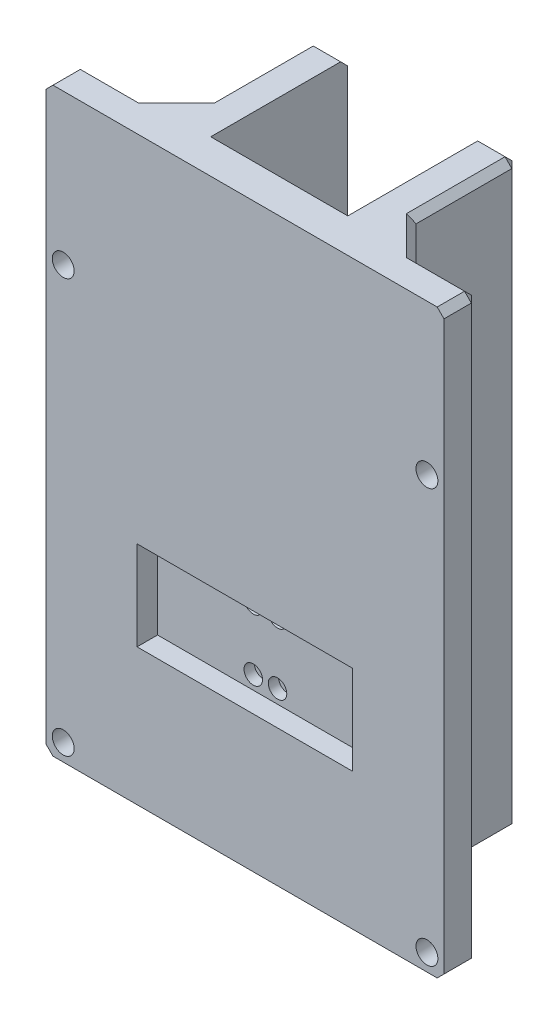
ISO-10303-21;
HEADER;
FILE_DESCRIPTION(('STEP AP214'),'2;1');
FILE_NAME('part.step','',(''),(''),'','','');
FILE_SCHEMA(('AUTOMOTIVE_DESIGN { 1 0 10303 214 1 1 1 1 }'));
ENDSEC;
DATA;
#1=APPLICATION_CONTEXT('core data for automotive mechanical design processes');
#2=APPLICATION_PROTOCOL_DEFINITION('international standard','automotive_design',2000,#1);
#3=PRODUCT_CONTEXT('',#1,'mechanical');
#4=PRODUCT('Part','Part','',(#3));
#5=PRODUCT_RELATED_PRODUCT_CATEGORY('part','',(#4));
#6=PRODUCT_DEFINITION_FORMATION('','',#4);
#7=PRODUCT_DEFINITION_CONTEXT('part definition',#1,'design');
#8=PRODUCT_DEFINITION('design','',#6,#7);
#9=PRODUCT_DEFINITION_SHAPE('','',#8);
#10=(LENGTH_UNIT() NAMED_UNIT(*) SI_UNIT(.MILLI.,.METRE.));
#11=(NAMED_UNIT(*) PLANE_ANGLE_UNIT() SI_UNIT($,.RADIAN.));
#12=(NAMED_UNIT(*) SI_UNIT($,.STERADIAN.) SOLID_ANGLE_UNIT());
#13=UNCERTAINTY_MEASURE_WITH_UNIT(LENGTH_MEASURE(1.E-05),#10,'distance_accuracy_value','');
#14=(GEOMETRIC_REPRESENTATION_CONTEXT(3) GLOBAL_UNCERTAINTY_ASSIGNED_CONTEXT((#13)) GLOBAL_UNIT_ASSIGNED_CONTEXT((#10,
#11,#12)) REPRESENTATION_CONTEXT('',''));
#15=CARTESIAN_POINT('',(0.,0.,0.));
#16=DIRECTION('',(0.,0.,1.));
#17=DIRECTION('',(1.,0.,0.));
#18=AXIS2_PLACEMENT_3D('',#15,#16,#17);
#19=CARTESIAN_POINT('',(0.,0.,995.050000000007));
#20=DIRECTION('',(0.,0.,-1.));
#21=DIRECTION('',(-1.,0.,0.));
#22=AXIS2_PLACEMENT_3D('',#19,#20,#21);
#23=PLANE('',#22);
#24=DIRECTION('',(0.,-1.,0.));
#25=VECTOR('',#24,1.);
#26=CARTESIAN_POINT('',(-22.7292355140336,-69.8381246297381,995.050000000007));
#27=LINE('',#26,#25);
#28=CARTESIAN_POINT('',(-22.7292355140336,14.1618753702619,995.050000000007));
#29=VERTEX_POINT('',#28);
#30=CARTESIAN_POINT('',(-22.7292355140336,-68.8381246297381,995.050000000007));
#31=VERTEX_POINT('',#30);
#32=EDGE_CURVE('E509',#29,#31,#27,.T.);
#33=ORIENTED_EDGE('',*,*,#32,.T.);
#34=DIRECTION('',(-1.,0.,0.));
#35=VECTOR('',#34,1.);
#36=CARTESIAN_POINT('',(-31.8042355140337,-68.8381246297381,995.050000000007));
#37=LINE('',#36,#35);
#38=CARTESIAN_POINT('',(-28.7474590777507,-68.8381246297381,995.050000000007));
#39=VERTEX_POINT('',#38);
#40=EDGE_CURVE('E692',#31,#39,#37,.T.);
#41=ORIENTED_EDGE('',*,*,#40,.T.);
#42=CARTESIAN_POINT('',(-29.3042355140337,-67.3381246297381,995.050000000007));
#43=DIRECTION('',(0.,0.,-1.));
#44=DIRECTION('',(-1.,0.,0.));
#45=AXIS2_PLACEMENT_3D('',#42,#43,#44);
#46=CIRCLE('',#45,1.60000000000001);
#47=CARTESIAN_POINT('',(-30.8042355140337,-66.7813481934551,995.050000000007));
#48=VERTEX_POINT('',#47);
#49=EDGE_CURVE('E441',#48,#39,#46,.T.);
#50=ORIENTED_EDGE('',*,*,#49,.F.);
#51=DIRECTION('',(0.,1.,0.));
#52=VECTOR('',#51,1.);
#53=CARTESIAN_POINT('',(-30.8042355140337,15.1618753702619,995.050000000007));
#54=LINE('',#53,#52);
#55=CARTESIAN_POINT('',(-30.8042355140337,-7.39490106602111,995.050000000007));
#56=VERTEX_POINT('',#55);
#57=EDGE_CURVE('E684',#48,#56,#54,.T.);
#58=ORIENTED_EDGE('',*,*,#57,.T.);
#59=CARTESIAN_POINT('',(-29.3042355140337,-6.83812462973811,995.050000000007));
#60=DIRECTION('',(0.,0.,-1.));
#61=DIRECTION('',(-1.,0.,0.));
#62=AXIS2_PLACEMENT_3D('',#59,#60,#61);
#63=CIRCLE('',#62,1.6);
#64=CARTESIAN_POINT('',(-30.8042355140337,-6.28134819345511,995.050000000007));
#65=VERTEX_POINT('',#64);
#66=EDGE_CURVE('E459',#65,#56,#63,.T.);
#67=ORIENTED_EDGE('',*,*,#66,.F.);
#68=DIRECTION('',(0.,1.,0.));
#69=VECTOR('',#68,1.);
#70=CARTESIAN_POINT('',(-30.8042355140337,15.1618753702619,995.050000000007));
#71=LINE('',#70,#69);
#72=CARTESIAN_POINT('',(-30.8042355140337,14.1618753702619,995.050000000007));
#73=VERTEX_POINT('',#72);
#74=EDGE_CURVE('E682',#65,#73,#71,.T.);
#75=ORIENTED_EDGE('',*,*,#74,.T.);
#76=DIRECTION('',(1.,0.,0.));
#77=VECTOR('',#76,1.);
#78=CARTESIAN_POINT('',(-22.7292355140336,14.1618753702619,995.050000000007));
#79=LINE('',#78,#77);
#80=EDGE_CURVE('E677',#73,#29,#79,.T.);
#81=ORIENTED_EDGE('',*,*,#80,.T.);
#82=EDGE_LOOP('',(#33,#41,#50,#58,#67,#75,#81));
#83=FACE_BOUND('',#82,.T.);
#84=ADVANCED_FACE('F50',(#83),#23,.T.);
#85=DIRECTION('',(0.,1.,0.));
#86=VECTOR('',#85,1.);
#87=CARTESIAN_POINT('',(17.3207644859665,15.1618753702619,995.050000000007));
#88=LINE('',#87,#86);
#89=CARTESIAN_POINT('',(17.3207644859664,-68.8381246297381,995.050000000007));
#90=VERTEX_POINT('',#89);
#91=CARTESIAN_POINT('',(17.3207644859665,14.1618753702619,995.050000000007));
#92=VERTEX_POINT('',#91);
#93=EDGE_CURVE('E482',#90,#92,#88,.T.);
#94=ORIENTED_EDGE('',*,*,#93,.T.);
#95=DIRECTION('',(1.,0.,0.));
#96=VECTOR('',#95,1.);
#97=CARTESIAN_POINT('',(26.3957644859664,14.1618753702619,995.050000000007));
#98=LINE('',#97,#96);
#99=CARTESIAN_POINT('',(25.3957644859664,14.1618753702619,995.050000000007));
#100=VERTEX_POINT('',#99);
#101=EDGE_CURVE('E591',#92,#100,#98,.T.);
#102=ORIENTED_EDGE('',*,*,#101,.T.);
#103=DIRECTION('',(0.,-1.,0.));
#104=VECTOR('',#103,1.);
#105=CARTESIAN_POINT('',(25.3957644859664,-69.8381246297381,995.050000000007));
#106=LINE('',#105,#104);
#107=CARTESIAN_POINT('',(25.3957644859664,-6.28134819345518,995.050000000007));
#108=VERTEX_POINT('',#107);
#109=EDGE_CURVE('E589',#100,#108,#106,.T.);
#110=ORIENTED_EDGE('',*,*,#109,.T.);
#111=CARTESIAN_POINT('',(23.8957644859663,-6.83812462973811,995.050000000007));
#112=DIRECTION('',(0.,0.,-1.));
#113=DIRECTION('',(-1.,0.,0.));
#114=AXIS2_PLACEMENT_3D('',#111,#112,#113);
#115=CIRCLE('',#114,1.6);
#116=CARTESIAN_POINT('',(25.3957644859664,-7.39490106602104,995.050000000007));
#117=VERTEX_POINT('',#116);
#118=EDGE_CURVE('E470',#117,#108,#115,.T.);
#119=ORIENTED_EDGE('',*,*,#118,.F.);
#120=DIRECTION('',(0.,-1.,0.));
#121=VECTOR('',#120,1.);
#122=CARTESIAN_POINT('',(25.3957644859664,-69.8381246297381,995.050000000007));
#123=LINE('',#122,#121);
#124=CARTESIAN_POINT('',(25.3957644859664,-66.7813481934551,995.050000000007));
#125=VERTEX_POINT('',#124);
#126=EDGE_CURVE('E581',#117,#125,#123,.T.);
#127=ORIENTED_EDGE('',*,*,#126,.T.);
#128=CARTESIAN_POINT('',(23.8957644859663,-67.3381246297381,995.050000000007));
#129=DIRECTION('',(0.,0.,-1.));
#130=DIRECTION('',(-1.,0.,0.));
#131=AXIS2_PLACEMENT_3D('',#128,#129,#130);
#132=CIRCLE('',#131,1.60000000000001);
#133=CARTESIAN_POINT('',(23.3389880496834,-68.8381246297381,995.050000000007));
#134=VERTEX_POINT('',#133);
#135=EDGE_CURVE('E448',#134,#125,#132,.T.);
#136=ORIENTED_EDGE('',*,*,#135,.F.);
#137=DIRECTION('',(-1.,0.,0.));
#138=VECTOR('',#137,1.);
#139=CARTESIAN_POINT('',(17.3207644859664,-68.8381246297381,995.050000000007));
#140=LINE('',#139,#138);
#141=EDGE_CURVE('E577',#134,#90,#140,.T.);
#142=ORIENTED_EDGE('',*,*,#141,.T.);
#143=EDGE_LOOP('',(#94,#102,#110,#119,#127,#136,#142));
#144=FACE_BOUND('',#143,.T.);
#145=ADVANCED_FACE('F993',(#144),#23,.T.);
#146=CARTESIAN_POINT('',(25.3957644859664,-67.8949010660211,995.050000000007));
#147=VERTEX_POINT('',#146);
#148=CARTESIAN_POINT('',(24.4525409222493,-68.8381246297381,995.050000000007));
#149=VERTEX_POINT('',#148);
#150=EDGE_CURVE('E455',#147,#149,#132,.T.);
#151=ORIENTED_EDGE('',*,*,#150,.F.);
#152=DIRECTION('',(0.,-1.,0.));
#153=VECTOR('',#152,1.);
#154=CARTESIAN_POINT('',(25.3957644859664,-69.8381246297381,995.050000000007));
#155=LINE('',#154,#153);
#156=CARTESIAN_POINT('',(25.3957644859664,-68.8381246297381,995.050000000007));
#157=VERTEX_POINT('',#156);
#158=EDGE_CURVE('E584',#147,#157,#155,.T.);
#159=ORIENTED_EDGE('',*,*,#158,.T.);
#160=DIRECTION('',(-1.,0.,0.));
#161=VECTOR('',#160,1.);
#162=CARTESIAN_POINT('',(17.3207644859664,-68.8381246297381,995.050000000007));
#163=LINE('',#162,#161);
#164=EDGE_CURVE('E576',#157,#149,#163,.T.);
#165=ORIENTED_EDGE('',*,*,#164,.T.);
#166=EDGE_LOOP('',(#151,#159,#165));
#167=FACE_BOUND('',#166,.T.);
#168=ADVANCED_FACE('F1000',(#167),#23,.T.);
#169=DIRECTION('',(0.,1.,0.));
#170=VECTOR('',#169,1.);
#171=CARTESIAN_POINT('',(7.32076448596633,-69.8381246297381,995.050000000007));
#172=LINE('',#171,#170);
#173=CARTESIAN_POINT('',(7.32076448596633,-69.8381246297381,995.050000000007));
#174=VERTEX_POINT('',#173);
#175=CARTESIAN_POINT('',(7.32076448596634,15.1618753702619,995.050000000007));
#176=VERTEX_POINT('',#175);
#177=EDGE_CURVE('E417',#174,#176,#172,.T.);
#178=ORIENTED_EDGE('',*,*,#177,.F.);
#179=DIRECTION('',(-1.,0.,0.));
#180=VECTOR('',#179,1.);
#181=CARTESIAN_POINT('',(26.3957644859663,-69.8381246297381,995.050000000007));
#182=LINE('',#181,#180);
#183=CARTESIAN_POINT('',(-12.7292355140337,-69.8381246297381,995.050000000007));
#184=VERTEX_POINT('',#183);
#185=EDGE_CURVE('E471',#174,#184,#182,.T.);
#186=ORIENTED_EDGE('',*,*,#185,.T.);
#187=DIRECTION('',(0.,1.,0.));
#188=VECTOR('',#187,1.);
#189=CARTESIAN_POINT('',(-12.7292355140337,-69.8381246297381,995.050000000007));
#190=LINE('',#189,#188);
#191=CARTESIAN_POINT('',(-12.7292355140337,15.1618753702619,995.050000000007));
#192=VERTEX_POINT('',#191);
#193=EDGE_CURVE('E430',#184,#192,#190,.T.);
#194=ORIENTED_EDGE('',*,*,#193,.T.);
#195=DIRECTION('',(1.,0.,0.));
#196=VECTOR('',#195,1.);
#197=CARTESIAN_POINT('',(26.3957644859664,15.1618753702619,995.050000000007));
#198=LINE('',#197,#196);
#199=EDGE_CURVE('E476',#192,#176,#198,.T.);
#200=ORIENTED_EDGE('',*,*,#199,.T.);
#201=EDGE_LOOP('',(#178,#186,#194,#200));
#202=FACE_BOUND('',#201,.T.);
#203=ADVANCED_FACE('F892',(#202),#23,.T.);
#204=CARTESIAN_POINT('',(-29.8610119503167,-68.8381246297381,995.050000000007));
#205=VERTEX_POINT('',#204);
#206=CARTESIAN_POINT('',(-30.8042355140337,-67.8949010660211,995.050000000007));
#207=VERTEX_POINT('',#206);
#208=EDGE_CURVE('E447',#205,#207,#46,.T.);
#209=ORIENTED_EDGE('',*,*,#208,.F.);
#210=DIRECTION('',(-1.,0.,0.));
#211=VECTOR('',#210,1.);
#212=CARTESIAN_POINT('',(-31.8042355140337,-68.8381246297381,995.050000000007));
#213=LINE('',#212,#211);
#214=CARTESIAN_POINT('',(-30.8042355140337,-68.8381246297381,995.050000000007));
#215=VERTEX_POINT('',#214);
#216=EDGE_CURVE('E691',#205,#215,#213,.T.);
#217=ORIENTED_EDGE('',*,*,#216,.T.);
#218=DIRECTION('',(0.,1.,0.));
#219=VECTOR('',#218,1.);
#220=CARTESIAN_POINT('',(-30.8042355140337,15.1618753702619,995.050000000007));
#221=LINE('',#220,#219);
#222=EDGE_CURVE('E686',#215,#207,#221,.T.);
#223=ORIENTED_EDGE('',*,*,#222,.T.);
#224=EDGE_LOOP('',(#209,#217,#223));
#225=FACE_BOUND('',#224,.T.);
#226=ADVANCED_FACE('F973',(#225),#23,.T.);
#227=CARTESIAN_POINT('',(0.,0.,1000.05000000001));
#228=DIRECTION('',(0.,0.,-1.));
#229=DIRECTION('',(-1.,0.,0.));
#230=AXIS2_PLACEMENT_3D('',#227,#228,#229);
#231=PLANE('',#230);
#232=DIRECTION('',(-1.,0.,0.));
#233=VECTOR('',#232,1.);
#234=CARTESIAN_POINT('',(-18.5042355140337,-36.7881246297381,1000.05000000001));
#235=LINE('',#234,#233);
#236=CARTESIAN_POINT('',(13.0457644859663,-36.7881246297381,1000.05000000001));
#237=VERTEX_POINT('',#236);
#238=CARTESIAN_POINT('',(-18.5042355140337,-36.7881246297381,1000.05000000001));
#239=VERTEX_POINT('',#238);
#240=EDGE_CURVE('E341',#237,#239,#235,.T.);
#241=ORIENTED_EDGE('',*,*,#240,.F.);
#242=DIRECTION('',(0.,1.,0.));
#243=VECTOR('',#242,1.);
#244=CARTESIAN_POINT('',(13.0457644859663,-36.7881246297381,1000.05000000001));
#245=LINE('',#244,#243);
#246=CARTESIAN_POINT('',(13.0457644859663,-49.8381246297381,1000.05000000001));
#247=VERTEX_POINT('',#246);
#248=EDGE_CURVE('E67',#247,#237,#245,.T.);
#249=ORIENTED_EDGE('',*,*,#248,.F.);
#250=DIRECTION('',(1.,0.,0.));
#251=VECTOR('',#250,1.);
#252=CARTESIAN_POINT('',(-18.5042355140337,-49.8381246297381,1000.05000000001));
#253=LINE('',#252,#251);
#254=CARTESIAN_POINT('',(-18.5042355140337,-49.8381246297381,1000.05000000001));
#255=VERTEX_POINT('',#254);
#256=EDGE_CURVE('E326',#255,#247,#253,.T.);
#257=ORIENTED_EDGE('',*,*,#256,.F.);
#258=DIRECTION('',(0.,-1.,0.));
#259=VECTOR('',#258,1.);
#260=CARTESIAN_POINT('',(-18.5042355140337,-36.7881246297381,1000.05000000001));
#261=LINE('',#260,#259);
#262=EDGE_CURVE('E333',#239,#255,#261,.T.);
#263=ORIENTED_EDGE('',*,*,#262,.F.);
#264=EDGE_LOOP('',(#241,#249,#257,#263));
#265=FACE_BOUND('',#264,.T.);
#266=DIRECTION('',(0.,-1.,0.));
#267=VECTOR('',#266,1.);
#268=CARTESIAN_POINT('',(26.3957644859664,15.1618753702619,1000.05000000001));
#269=LINE('',#268,#267);
#270=CARTESIAN_POINT('',(26.3957644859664,14.1618753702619,1000.05000000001));
#271=VERTEX_POINT('',#270);
#272=CARTESIAN_POINT('',(26.3957644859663,-68.8381246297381,1000.05000000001));
#273=VERTEX_POINT('',#272);
#274=EDGE_CURVE('E473',#271,#273,#269,.T.);
#275=ORIENTED_EDGE('',*,*,#274,.F.);
#276=DIRECTION('',(0.707106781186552,-0.707106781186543,0.));
#277=VECTOR('',#276,1.);
#278=CARTESIAN_POINT('',(26.3957644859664,14.1618753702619,1000.05000000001));
#279=LINE('',#278,#277);
#280=CARTESIAN_POINT('',(25.3957644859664,15.1618753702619,1000.05000000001));
#281=VERTEX_POINT('',#280);
#282=EDGE_CURVE('E615',#271,#281,#279,.F.);
#283=ORIENTED_EDGE('',*,*,#282,.T.);
#284=DIRECTION('',(1.,0.,0.));
#285=VECTOR('',#284,1.);
#286=CARTESIAN_POINT('',(26.3957644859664,15.1618753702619,1000.05000000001));
#287=LINE('',#286,#285);
#288=CARTESIAN_POINT('',(-30.8042355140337,15.1618753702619,1000.05000000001));
#289=VERTEX_POINT('',#288);
#290=EDGE_CURVE('E478',#289,#281,#287,.T.);
#291=ORIENTED_EDGE('',*,*,#290,.F.);
#292=DIRECTION('',(0.707106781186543,0.707106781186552,0.));
#293=VECTOR('',#292,1.);
#294=CARTESIAN_POINT('',(-30.8042355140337,15.1618753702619,1000.05000000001));
#295=LINE('',#294,#293);
#296=CARTESIAN_POINT('',(-31.8042355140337,14.1618753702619,1000.05000000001));
#297=VERTEX_POINT('',#296);
#298=EDGE_CURVE('E607',#289,#297,#295,.F.);
#299=ORIENTED_EDGE('',*,*,#298,.T.);
#300=DIRECTION('',(0.,1.,0.));
#301=VECTOR('',#300,1.);
#302=CARTESIAN_POINT('',(-31.8042355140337,15.1618753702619,1000.05000000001));
#303=LINE('',#302,#301);
#304=CARTESIAN_POINT('',(-31.8042355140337,-68.8381246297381,1000.05000000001));
#305=VERTEX_POINT('',#304);
#306=EDGE_CURVE('E495',#305,#297,#303,.T.);
#307=ORIENTED_EDGE('',*,*,#306,.F.);
#308=DIRECTION('',(-0.707106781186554,0.707106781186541,0.));
#309=VECTOR('',#308,1.);
#310=CARTESIAN_POINT('',(-31.8042355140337,-68.8381246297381,1000.05000000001));
#311=LINE('',#310,#309);
#312=CARTESIAN_POINT('',(-30.8042355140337,-69.8381246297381,1000.05000000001));
#313=VERTEX_POINT('',#312);
#314=EDGE_CURVE('E602',#305,#313,#311,.F.);
#315=ORIENTED_EDGE('',*,*,#314,.T.);
#316=DIRECTION('',(-1.,0.,0.));
#317=VECTOR('',#316,1.);
#318=CARTESIAN_POINT('',(26.3957644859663,-69.8381246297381,1000.05000000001));
#319=LINE('',#318,#317);
#320=CARTESIAN_POINT('',(25.3957644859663,-69.8381246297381,1000.05000000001));
#321=VERTEX_POINT('',#320);
#322=EDGE_CURVE('E486',#321,#313,#319,.T.);
#323=ORIENTED_EDGE('',*,*,#322,.F.);
#324=DIRECTION('',(-0.707106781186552,-0.707106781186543,0.));
#325=VECTOR('',#324,1.);
#326=CARTESIAN_POINT('',(25.3957644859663,-69.8381246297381,1000.05000000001));
#327=LINE('',#326,#325);
#328=EDGE_CURVE('E606',#321,#273,#327,.F.);
#329=ORIENTED_EDGE('',*,*,#328,.T.);
#330=EDGE_LOOP('',(#275,#283,#291,#299,#307,#315,#323,#329));
#331=FACE_BOUND('',#330,.T.);
#332=CARTESIAN_POINT('',(23.8957644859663,-6.83812462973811,1000.05000000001));
#333=DIRECTION('',(0.,0.,-1.));
#334=DIRECTION('',(-1.,0.,0.));
#335=AXIS2_PLACEMENT_3D('',#332,#333,#334);
#336=CIRCLE('',#335,1.6);
#337=CARTESIAN_POINT('',(22.2957644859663,-6.83812462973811,1000.05000000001));
#338=VERTEX_POINT('',#337);
#339=EDGE_CURVE('E465',#338,#338,#336,.T.);
#340=ORIENTED_EDGE('',*,*,#339,.T.);
#341=EDGE_LOOP('',(#340));
#342=FACE_BOUND('',#341,.T.);
#343=CARTESIAN_POINT('',(-29.3042355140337,-6.83812462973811,1000.05000000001));
#344=DIRECTION('',(0.,0.,-1.));
#345=DIRECTION('',(-1.,0.,0.));
#346=AXIS2_PLACEMENT_3D('',#343,#344,#345);
#347=CIRCLE('',#346,1.6);
#348=CARTESIAN_POINT('',(-30.9042355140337,-6.83812462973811,1000.05000000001));
#349=VERTEX_POINT('',#348);
#350=EDGE_CURVE('E463',#349,#349,#347,.T.);
#351=ORIENTED_EDGE('',*,*,#350,.T.);
#352=EDGE_LOOP('',(#351));
#353=FACE_BOUND('',#352,.T.);
#354=CARTESIAN_POINT('',(23.8957644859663,-67.3381246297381,1000.05000000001));
#355=DIRECTION('',(0.,0.,-1.));
#356=DIRECTION('',(-1.,0.,0.));
#357=AXIS2_PLACEMENT_3D('',#354,#355,#356);
#358=CIRCLE('',#357,1.60000000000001);
#359=CARTESIAN_POINT('',(22.2957644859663,-67.3381246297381,1000.05000000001));
#360=VERTEX_POINT('',#359);
#361=EDGE_CURVE('E444',#360,#360,#358,.T.);
#362=ORIENTED_EDGE('',*,*,#361,.T.);
#363=EDGE_LOOP('',(#362));
#364=FACE_BOUND('',#363,.T.);
#365=CARTESIAN_POINT('',(-29.3042355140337,-67.3381246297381,1000.05000000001));
#366=DIRECTION('',(0.,0.,-1.));
#367=DIRECTION('',(-1.,0.,0.));
#368=AXIS2_PLACEMENT_3D('',#365,#366,#367);
#369=CIRCLE('',#368,1.60000000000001);
#370=CARTESIAN_POINT('',(-30.9042355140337,-67.3381246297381,1000.05000000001));
#371=VERTEX_POINT('',#370);
#372=EDGE_CURVE('E421',#371,#371,#369,.T.);
#373=ORIENTED_EDGE('',*,*,#372,.T.);
#374=EDGE_LOOP('',(#373));
#375=FACE_BOUND('',#374,.T.);
#376=ADVANCED_FACE('F860',(#265,#331,#342,#353,#364,#375),#231,.F.);
#377=CARTESIAN_POINT('',(26.3957644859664,15.1618753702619,995.050000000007));
#378=DIRECTION('',(-1.,0.,0.));
#379=DIRECTION('',(0.,-1.,0.));
#380=AXIS2_PLACEMENT_3D('',#377,#378,#379);
#381=PLANE('',#380);
#382=DIRECTION('',(0.,1.,0.));
#383=VECTOR('',#382,1.);
#384=CARTESIAN_POINT('',(26.3957644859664,15.1618753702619,996.050000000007));
#385=LINE('',#384,#383);
#386=CARTESIAN_POINT('',(26.3957644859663,-68.8381246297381,996.050000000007));
#387=VERTEX_POINT('',#386);
#388=CARTESIAN_POINT('',(26.3957644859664,14.1618753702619,996.050000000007));
#389=VERTEX_POINT('',#388);
#390=EDGE_CURVE('E592',#387,#389,#385,.T.);
#391=ORIENTED_EDGE('',*,*,#390,.T.);
#392=DIRECTION('',(0.,0.,1.));
#393=VECTOR('',#392,1.);
#394=CARTESIAN_POINT('',(26.3957644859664,14.1618753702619,995.050000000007));
#395=LINE('',#394,#393);
#396=EDGE_CURVE('E598',#389,#271,#395,.T.);
#397=ORIENTED_EDGE('',*,*,#396,.T.);
#398=ORIENTED_EDGE('',*,*,#274,.T.);
#399=DIRECTION('',(0.,0.,-1.));
#400=VECTOR('',#399,1.);
#401=CARTESIAN_POINT('',(26.3957644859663,-68.8381246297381,995.050000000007));
#402=LINE('',#401,#400);
#403=EDGE_CURVE('E600',#273,#387,#402,.T.);
#404=ORIENTED_EDGE('',*,*,#403,.T.);
#405=EDGE_LOOP('',(#391,#397,#398,#404));
#406=FACE_BOUND('',#405,.T.);
#407=ADVANCED_FACE('F968',(#406),#381,.F.);
#408=CARTESIAN_POINT('',(26.3957644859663,-69.8381246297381,995.050000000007));
#409=DIRECTION('',(0.,1.,0.));
#410=DIRECTION('',(0.,0.,1.));
#411=AXIS2_PLACEMENT_3D('',#408,#409,#410);
#412=PLANE('',#411);
#413=DIRECTION('',(1.,0.,0.));
#414=VECTOR('',#413,1.);
#415=CARTESIAN_POINT('',(26.3957644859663,-69.8381246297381,996.050000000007));
#416=LINE('',#415,#414);
#417=CARTESIAN_POINT('',(16.9065509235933,-69.8381246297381,996.050000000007));
#418=VERTEX_POINT('',#417);
#419=CARTESIAN_POINT('',(25.3957644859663,-69.8381246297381,996.050000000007));
#420=VERTEX_POINT('',#419);
#421=EDGE_CURVE('E638',#418,#420,#416,.T.);
#422=ORIENTED_EDGE('',*,*,#421,.T.);
#423=DIRECTION('',(0.,0.,1.));
#424=VECTOR('',#423,1.);
#425=CARTESIAN_POINT('',(25.3957644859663,-69.8381246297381,995.050000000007));
#426=LINE('',#425,#424);
#427=EDGE_CURVE('E645',#420,#321,#426,.T.);
#428=ORIENTED_EDGE('',*,*,#427,.T.);
#429=ORIENTED_EDGE('',*,*,#322,.T.);
#430=DIRECTION('',(0.,0.,-1.));
#431=VECTOR('',#430,1.);
#432=CARTESIAN_POINT('',(-30.8042355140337,-69.8381246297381,995.050000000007));
#433=LINE('',#432,#431);
#434=CARTESIAN_POINT('',(-30.8042355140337,-69.8381246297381,996.050000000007));
#435=VERTEX_POINT('',#434);
#436=EDGE_CURVE('E624',#313,#435,#433,.T.);
#437=ORIENTED_EDGE('',*,*,#436,.T.);
#438=DIRECTION('',(1.,0.,0.));
#439=VECTOR('',#438,1.);
#440=CARTESIAN_POINT('',(-22.7292355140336,-69.8381246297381,996.050000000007));
#441=LINE('',#440,#439);
#442=CARTESIAN_POINT('',(-22.3150219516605,-69.8381246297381,996.050000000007));
#443=VERTEX_POINT('',#442);
#444=EDGE_CURVE('E623',#435,#443,#441,.T.);
#445=ORIENTED_EDGE('',*,*,#444,.T.);
#446=DIRECTION('',(0.707106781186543,0.,-0.707106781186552));
#447=VECTOR('',#446,1.);
#448=CARTESIAN_POINT('',(2.54037126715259,-69.8381246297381,971.194606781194));
#449=LINE('',#448,#447);
#450=CARTESIAN_POINT('',(-16.7292355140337,-69.8381246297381,990.46421356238));
#451=VERTEX_POINT('',#450);
#452=EDGE_CURVE('E616',#443,#451,#449,.T.);
#453=ORIENTED_EDGE('',*,*,#452,.T.);
#454=DIRECTION('',(0.,0.,-1.));
#455=VECTOR('',#454,1.);
#456=CARTESIAN_POINT('',(-16.7292355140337,-69.8381246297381,975.050000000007));
#457=LINE('',#456,#455);
#458=CARTESIAN_POINT('',(-16.7292355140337,-69.8381246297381,976.050000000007));
#459=VERTEX_POINT('',#458);
#460=EDGE_CURVE('E614',#451,#459,#457,.T.);
#461=ORIENTED_EDGE('',*,*,#460,.T.);
#462=DIRECTION('',(1.,0.,0.));
#463=VECTOR('',#462,1.);
#464=CARTESIAN_POINT('',(-12.7292355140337,-69.8381246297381,976.050000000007));
#465=LINE('',#464,#463);
#466=CARTESIAN_POINT('',(-12.7292355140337,-69.8381246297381,976.050000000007));
#467=VERTEX_POINT('',#466);
#468=EDGE_CURVE('E630',#459,#467,#465,.T.);
#469=ORIENTED_EDGE('',*,*,#468,.T.);
#470=DIRECTION('',(0.,0.,-1.));
#471=VECTOR('',#470,1.);
#472=CARTESIAN_POINT('',(-12.7292355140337,-69.8381246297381,975.050000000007));
#473=LINE('',#472,#471);
#474=EDGE_CURVE('E431',#184,#467,#473,.T.);
#475=ORIENTED_EDGE('',*,*,#474,.F.);
#476=ORIENTED_EDGE('',*,*,#185,.F.);
#477=DIRECTION('',(0.,0.,1.));
#478=VECTOR('',#477,1.);
#479=CARTESIAN_POINT('',(7.32076448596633,-69.8381246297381,975.050000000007));
#480=LINE('',#479,#478);
#481=CARTESIAN_POINT('',(7.32076448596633,-69.8381246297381,976.050000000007));
#482=VERTEX_POINT('',#481);
#483=EDGE_CURVE('E412',#482,#174,#480,.T.);
#484=ORIENTED_EDGE('',*,*,#483,.F.);
#485=DIRECTION('',(1.,0.,0.));
#486=VECTOR('',#485,1.);
#487=CARTESIAN_POINT('',(12.3207644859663,-69.8381246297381,976.050000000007));
#488=LINE('',#487,#486);
#489=CARTESIAN_POINT('',(11.3207644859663,-69.8381246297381,976.050000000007));
#490=VERTEX_POINT('',#489);
#491=EDGE_CURVE('E629',#482,#490,#488,.T.);
#492=ORIENTED_EDGE('',*,*,#491,.T.);
#493=DIRECTION('',(0.,0.,1.));
#494=VECTOR('',#493,1.);
#495=CARTESIAN_POINT('',(11.3207644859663,-69.8381246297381,990.050000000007));
#496=LINE('',#495,#494);
#497=CARTESIAN_POINT('',(11.3207644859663,-69.8381246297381,990.46421356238));
#498=VERTEX_POINT('',#497);
#499=EDGE_CURVE('E633',#490,#498,#496,.T.);
#500=ORIENTED_EDGE('',*,*,#499,.T.);
#501=DIRECTION('',(0.707106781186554,0.,0.707106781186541));
#502=VECTOR('',#501,1.);
#503=CARTESIAN_POINT('',(21.1511577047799,-69.8381246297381,1000.29460678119));
#504=LINE('',#503,#502);
#505=EDGE_CURVE('E636',#498,#418,#504,.T.);
#506=ORIENTED_EDGE('',*,*,#505,.T.);
#507=EDGE_LOOP('',(#422,#428,#429,#437,#445,#453,#461,#469,#475,#476,#484,#492,#500,#506));
#508=FACE_BOUND('',#507,.T.);
#509=ADVANCED_FACE('F938',(#508),#412,.F.);
#510=CARTESIAN_POINT('',(-31.8042355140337,15.1618753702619,995.050000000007));
#511=DIRECTION('',(1.,0.,0.));
#512=DIRECTION('',(0.,1.,0.));
#513=AXIS2_PLACEMENT_3D('',#510,#511,#512);
#514=PLANE('',#513);
#515=ORIENTED_EDGE('',*,*,#306,.T.);
#516=DIRECTION('',(0.,0.,-1.));
#517=VECTOR('',#516,1.);
#518=CARTESIAN_POINT('',(-31.8042355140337,14.1618753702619,995.050000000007));
#519=LINE('',#518,#517);
#520=CARTESIAN_POINT('',(-31.8042355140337,14.1618753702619,996.050000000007));
#521=VERTEX_POINT('',#520);
#522=EDGE_CURVE('E676',#297,#521,#519,.T.);
#523=ORIENTED_EDGE('',*,*,#522,.T.);
#524=DIRECTION('',(0.,-1.,0.));
#525=VECTOR('',#524,1.);
#526=CARTESIAN_POINT('',(-31.8042355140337,-69.8381246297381,996.050000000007));
#527=LINE('',#526,#525);
#528=CARTESIAN_POINT('',(-31.8042355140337,-68.8381246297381,996.050000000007));
#529=VERTEX_POINT('',#528);
#530=EDGE_CURVE('E666',#521,#529,#527,.T.);
#531=ORIENTED_EDGE('',*,*,#530,.T.);
#532=DIRECTION('',(0.,0.,1.));
#533=VECTOR('',#532,1.);
#534=CARTESIAN_POINT('',(-31.8042355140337,-68.8381246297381,995.050000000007));
#535=LINE('',#534,#533);
#536=EDGE_CURVE('E674',#529,#305,#535,.T.);
#537=ORIENTED_EDGE('',*,*,#536,.T.);
#538=EDGE_LOOP('',(#515,#523,#531,#537));
#539=FACE_BOUND('',#538,.T.);
#540=ADVANCED_FACE('F1011',(#539),#514,.F.);
#541=CARTESIAN_POINT('',(26.3957644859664,15.1618753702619,995.050000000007));
#542=DIRECTION('',(0.,-1.,0.));
#543=DIRECTION('',(0.,0.,-1.));
#544=AXIS2_PLACEMENT_3D('',#541,#542,#543);
#545=PLANE('',#544);
#546=DIRECTION('',(0.,0.,-1.));
#547=VECTOR('',#546,1.);
#548=CARTESIAN_POINT('',(11.3207644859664,15.1618753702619,975.050000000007));
#549=LINE('',#548,#547);
#550=CARTESIAN_POINT('',(11.3207644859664,15.1618753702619,990.46421356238));
#551=VERTEX_POINT('',#550);
#552=CARTESIAN_POINT('',(11.3207644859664,15.1618753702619,976.050000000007));
#553=VERTEX_POINT('',#552);
#554=EDGE_CURVE('E537',#551,#553,#549,.T.);
#555=ORIENTED_EDGE('',*,*,#554,.T.);
#556=DIRECTION('',(-1.,0.,0.));
#557=VECTOR('',#556,1.);
#558=CARTESIAN_POINT('',(7.32076448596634,15.1618753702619,976.050000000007));
#559=LINE('',#558,#557);
#560=CARTESIAN_POINT('',(7.32076448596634,15.1618753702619,976.050000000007));
#561=VERTEX_POINT('',#560);
#562=EDGE_CURVE('E542',#553,#561,#559,.T.);
#563=ORIENTED_EDGE('',*,*,#562,.T.);
#564=DIRECTION('',(0.,0.,1.));
#565=VECTOR('',#564,1.);
#566=CARTESIAN_POINT('',(7.32076448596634,15.1618753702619,975.050000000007));
#567=LINE('',#566,#565);
#568=EDGE_CURVE('E413',#561,#176,#567,.T.);
#569=ORIENTED_EDGE('',*,*,#568,.T.);
#570=ORIENTED_EDGE('',*,*,#199,.F.);
#571=DIRECTION('',(0.,0.,-1.));
#572=VECTOR('',#571,1.);
#573=CARTESIAN_POINT('',(-12.7292355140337,15.1618753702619,975.050000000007));
#574=LINE('',#573,#572);
#575=CARTESIAN_POINT('',(-12.7292355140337,15.1618753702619,976.050000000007));
#576=VERTEX_POINT('',#575);
#577=EDGE_CURVE('E418',#192,#576,#574,.T.);
#578=ORIENTED_EDGE('',*,*,#577,.T.);
#579=DIRECTION('',(-1.,0.,0.));
#580=VECTOR('',#579,1.);
#581=CARTESIAN_POINT('',(-17.7292355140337,15.1618753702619,976.050000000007));
#582=LINE('',#581,#580);
#583=CARTESIAN_POINT('',(-16.7292355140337,15.1618753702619,976.050000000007));
#584=VERTEX_POINT('',#583);
#585=EDGE_CURVE('E526',#576,#584,#582,.T.);
#586=ORIENTED_EDGE('',*,*,#585,.T.);
#587=DIRECTION('',(0.,0.,1.));
#588=VECTOR('',#587,1.);
#589=CARTESIAN_POINT('',(-16.7292355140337,15.1618753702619,990.050000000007));
#590=LINE('',#589,#588);
#591=CARTESIAN_POINT('',(-16.7292355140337,15.1618753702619,990.46421356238));
#592=VERTEX_POINT('',#591);
#593=EDGE_CURVE('E511',#584,#592,#590,.T.);
#594=ORIENTED_EDGE('',*,*,#593,.T.);
#595=DIRECTION('',(-0.707106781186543,0.,0.707106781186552));
#596=VECTOR('',#595,1.);
#597=CARTESIAN_POINT('',(2.5403712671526,15.1618753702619,971.194606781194));
#598=LINE('',#597,#596);
#599=CARTESIAN_POINT('',(-22.3150219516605,15.1618753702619,996.050000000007));
#600=VERTEX_POINT('',#599);
#601=EDGE_CURVE('E519',#592,#600,#598,.T.);
#602=ORIENTED_EDGE('',*,*,#601,.T.);
#603=DIRECTION('',(-1.,0.,0.));
#604=VECTOR('',#603,1.);
#605=CARTESIAN_POINT('',(-31.8042355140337,15.1618753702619,996.050000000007));
#606=LINE('',#605,#604);
#607=CARTESIAN_POINT('',(-30.8042355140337,15.1618753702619,996.050000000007));
#608=VERTEX_POINT('',#607);
#609=EDGE_CURVE('E516',#600,#608,#606,.T.);
#610=ORIENTED_EDGE('',*,*,#609,.T.);
#611=DIRECTION('',(0.,0.,1.));
#612=VECTOR('',#611,1.);
#613=CARTESIAN_POINT('',(-30.8042355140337,15.1618753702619,995.050000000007));
#614=LINE('',#613,#612);
#615=EDGE_CURVE('E524',#608,#289,#614,.T.);
#616=ORIENTED_EDGE('',*,*,#615,.T.);
#617=ORIENTED_EDGE('',*,*,#290,.T.);
#618=DIRECTION('',(0.,0.,-1.));
#619=VECTOR('',#618,1.);
#620=CARTESIAN_POINT('',(25.3957644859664,15.1618753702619,995.050000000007));
#621=LINE('',#620,#619);
#622=CARTESIAN_POINT('',(25.3957644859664,15.1618753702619,996.050000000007));
#623=VERTEX_POINT('',#622);
#624=EDGE_CURVE('E527',#281,#623,#621,.T.);
#625=ORIENTED_EDGE('',*,*,#624,.T.);
#626=DIRECTION('',(-1.,0.,0.));
#627=VECTOR('',#626,1.);
#628=CARTESIAN_POINT('',(17.3207644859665,15.1618753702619,996.050000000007));
#629=LINE('',#628,#627);
#630=CARTESIAN_POINT('',(16.9065509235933,15.1618753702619,996.050000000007));
#631=VERTEX_POINT('',#630);
#632=EDGE_CURVE('E535',#623,#631,#629,.T.);
#633=ORIENTED_EDGE('',*,*,#632,.T.);
#634=DIRECTION('',(-0.707106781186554,0.,-0.707106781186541));
#635=VECTOR('',#634,1.);
#636=CARTESIAN_POINT('',(21.1511577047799,15.1618753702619,1000.29460678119));
#637=LINE('',#636,#635);
#638=EDGE_CURVE('E533',#631,#551,#637,.T.);
#639=ORIENTED_EDGE('',*,*,#638,.T.);
#640=EDGE_LOOP('',(#555,#563,#569,#570,#578,#586,#594,#602,#610,#616,#617,#625,#633,#639));
#641=FACE_BOUND('',#640,.T.);
#642=ADVANCED_FACE('F853',(#641),#545,.F.);
#643=CARTESIAN_POINT('',(23.8957644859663,-6.83812462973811,995.050000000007));
#644=DIRECTION('',(0.,0.,1.));
#645=DIRECTION('',(1.,0.,0.));
#646=AXIS2_PLACEMENT_3D('',#643,#644,#645);
#647=CYLINDRICAL_SURFACE('',#646,1.6);
#648=ORIENTED_EDGE('',*,*,#118,.T.);
#649=CARTESIAN_POINT('',(23.8957644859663,-6.83812462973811,993.550000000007));
#650=DIRECTION('',(0.707106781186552,0.,-0.707106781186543));
#651=DIRECTION('',(0.707106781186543,0.,0.707106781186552));
#652=AXIS2_PLACEMENT_3D('',#649,#650,#651);
#653=ELLIPSE('',#652,2.26274169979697,1.6);
#654=EDGE_CURVE('E643',#108,#117,#653,.T.);
#655=ORIENTED_EDGE('',*,*,#654,.T.);
#656=EDGE_LOOP('',(#648,#655));
#657=FACE_BOUND('',#656,.T.);
#658=ORIENTED_EDGE('',*,*,#339,.F.);
#659=EDGE_LOOP('',(#658));
#660=FACE_BOUND('',#659,.T.);
#661=ADVANCED_FACE('F963',(#657,#660),#647,.F.);
#662=CARTESIAN_POINT('',(-29.3042355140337,-6.83812462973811,995.050000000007));
#663=DIRECTION('',(0.,0.,1.));
#664=DIRECTION('',(1.,0.,0.));
#665=AXIS2_PLACEMENT_3D('',#662,#663,#664);
#666=CYLINDRICAL_SURFACE('',#665,1.6);
#667=ORIENTED_EDGE('',*,*,#66,.T.);
#668=CARTESIAN_POINT('',(-29.3042355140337,-6.83812462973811,993.550000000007));
#669=DIRECTION('',(-0.707106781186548,0.,-0.707106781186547));
#670=DIRECTION('',(-0.707106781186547,0.,0.707106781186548));
#671=AXIS2_PLACEMENT_3D('',#668,#669,#670);
#672=ELLIPSE('',#671,2.26274169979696,1.6);
#673=EDGE_CURVE('E703',#56,#65,#672,.T.);
#674=ORIENTED_EDGE('',*,*,#673,.T.);
#675=EDGE_LOOP('',(#667,#674));
#676=FACE_BOUND('',#675,.T.);
#677=ORIENTED_EDGE('',*,*,#350,.F.);
#678=EDGE_LOOP('',(#677));
#679=FACE_BOUND('',#678,.T.);
#680=ADVANCED_FACE('F959',(#676,#679),#666,.F.);
#681=CARTESIAN_POINT('',(23.8957644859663,-67.3381246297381,995.050000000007));
#682=DIRECTION('',(0.,0.,1.));
#683=DIRECTION('',(1.,0.,0.));
#684=AXIS2_PLACEMENT_3D('',#681,#682,#683);
#685=CYLINDRICAL_SURFACE('',#684,1.60000000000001);
#686=ORIENTED_EDGE('',*,*,#135,.T.);
#687=CARTESIAN_POINT('',(23.8957644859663,-67.3381246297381,993.550000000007));
#688=DIRECTION('',(0.707106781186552,0.,-0.707106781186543));
#689=DIRECTION('',(0.707106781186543,0.,0.707106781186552));
#690=AXIS2_PLACEMENT_3D('',#687,#688,#689);
#691=ELLIPSE('',#690,2.26274169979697,1.60000000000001);
#692=EDGE_CURVE('E652',#125,#147,#691,.T.);
#693=ORIENTED_EDGE('',*,*,#692,.T.);
#694=ORIENTED_EDGE('',*,*,#150,.T.);
#695=CARTESIAN_POINT('',(23.8957644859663,-67.3381246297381,993.550000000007));
#696=DIRECTION('',(0.,-0.707106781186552,-0.707106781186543));
#697=DIRECTION('',(0.,-0.707106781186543,0.707106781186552));
#698=AXIS2_PLACEMENT_3D('',#695,#696,#697);
#699=ELLIPSE('',#698,2.26274169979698,1.60000000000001);
#700=EDGE_CURVE('E647',#149,#134,#699,.T.);
#701=ORIENTED_EDGE('',*,*,#700,.T.);
#702=EDGE_LOOP('',(#686,#693,#694,#701));
#703=FACE_BOUND('',#702,.T.);
#704=ORIENTED_EDGE('',*,*,#361,.F.);
#705=EDGE_LOOP('',(#704));
#706=FACE_BOUND('',#705,.T.);
#707=ADVANCED_FACE('F962',(#703,#706),#685,.F.);
#708=CARTESIAN_POINT('',(-29.3042355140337,-67.3381246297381,995.050000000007));
#709=DIRECTION('',(0.,0.,1.));
#710=DIRECTION('',(1.,0.,0.));
#711=AXIS2_PLACEMENT_3D('',#708,#709,#710);
#712=CYLINDRICAL_SURFACE('',#711,1.60000000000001);
#713=ORIENTED_EDGE('',*,*,#49,.T.);
#714=CARTESIAN_POINT('',(-29.3042355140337,-67.3381246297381,993.550000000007));
#715=DIRECTION('',(0.,-0.707106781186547,-0.707106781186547));
#716=DIRECTION('',(0.,-0.707106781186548,0.707106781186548));
#717=AXIS2_PLACEMENT_3D('',#714,#715,#716);
#718=ELLIPSE('',#717,2.26274169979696,1.60000000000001);
#719=EDGE_CURVE('E701',#39,#205,#718,.T.);
#720=ORIENTED_EDGE('',*,*,#719,.T.);
#721=ORIENTED_EDGE('',*,*,#208,.T.);
#722=CARTESIAN_POINT('',(-29.3042355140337,-67.3381246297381,993.550000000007));
#723=DIRECTION('',(-0.707106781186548,0.,-0.707106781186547));
#724=DIRECTION('',(-0.707106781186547,0.,0.707106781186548));
#725=AXIS2_PLACEMENT_3D('',#722,#723,#724);
#726=ELLIPSE('',#725,2.26274169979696,1.60000000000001);
#727=EDGE_CURVE('E698',#207,#48,#726,.T.);
#728=ORIENTED_EDGE('',*,*,#727,.T.);
#729=EDGE_LOOP('',(#713,#720,#721,#728));
#730=FACE_BOUND('',#729,.T.);
#731=ORIENTED_EDGE('',*,*,#372,.F.);
#732=EDGE_LOOP('',(#731));
#733=FACE_BOUND('',#732,.T.);
#734=ADVANCED_FACE('F949',(#730,#733),#712,.F.);
#735=CARTESIAN_POINT('',(-12.7292355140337,-69.8381246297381,975.050000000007));
#736=DIRECTION('',(0.,0.,-1.));
#737=DIRECTION('',(-1.,0.,0.));
#738=AXIS2_PLACEMENT_3D('',#735,#736,#737);
#739=PLANE('',#738);
#740=DIRECTION('',(0.,1.,0.));
#741=VECTOR('',#740,1.);
#742=CARTESIAN_POINT('',(-12.7292355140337,-69.8381246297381,975.050000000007));
#743=LINE('',#742,#741);
#744=CARTESIAN_POINT('',(-12.7292355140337,-68.8381246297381,975.050000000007));
#745=VERTEX_POINT('',#744);
#746=CARTESIAN_POINT('',(-12.7292355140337,14.1618753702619,975.050000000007));
#747=VERTEX_POINT('',#746);
#748=EDGE_CURVE('E406',#745,#747,#743,.T.);
#749=ORIENTED_EDGE('',*,*,#748,.F.);
#750=DIRECTION('',(-1.,0.,0.));
#751=VECTOR('',#750,1.);
#752=CARTESIAN_POINT('',(-17.7292355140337,-68.8381246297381,975.050000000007));
#753=LINE('',#752,#751);
#754=CARTESIAN_POINT('',(-16.7292355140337,-68.8381246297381,975.050000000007));
#755=VERTEX_POINT('',#754);
#756=EDGE_CURVE('E659',#745,#755,#753,.T.);
#757=ORIENTED_EDGE('',*,*,#756,.T.);
#758=DIRECTION('',(0.,1.,0.));
#759=VECTOR('',#758,1.);
#760=CARTESIAN_POINT('',(-16.7292355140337,-69.8381246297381,975.050000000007));
#761=LINE('',#760,#759);
#762=CARTESIAN_POINT('',(-16.7292355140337,14.1618753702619,975.050000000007));
#763=VERTEX_POINT('',#762);
#764=EDGE_CURVE('E651',#755,#763,#761,.T.);
#765=ORIENTED_EDGE('',*,*,#764,.T.);
#766=DIRECTION('',(1.,0.,0.));
#767=VECTOR('',#766,1.);
#768=CARTESIAN_POINT('',(-12.7292355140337,14.1618753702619,975.050000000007));
#769=LINE('',#768,#767);
#770=EDGE_CURVE('E660',#763,#747,#769,.T.);
#771=ORIENTED_EDGE('',*,*,#770,.T.);
#772=EDGE_LOOP('',(#749,#757,#765,#771));
#773=FACE_BOUND('',#772,.T.);
#774=ADVANCED_FACE('F979',(#773),#739,.T.);
#775=CARTESIAN_POINT('',(-12.7292355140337,-69.8381246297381,975.050000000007));
#776=DIRECTION('',(1.,0.,0.));
#777=DIRECTION('',(0.,0.,-1.));
#778=AXIS2_PLACEMENT_3D('',#775,#776,#777);
#779=PLANE('',#778);
#780=CARTESIAN_POINT('',(-12.7292355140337,-47.9631246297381,985.050000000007));
#781=DIRECTION('',(1.,0.,0.));
#782=DIRECTION('',(0.,0.,-1.));
#783=AXIS2_PLACEMENT_3D('',#780,#781,#782);
#784=CIRCLE('',#783,2.10000000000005);
#785=CARTESIAN_POINT('',(-12.7292355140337,-47.9631246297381,982.950000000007));
#786=VERTEX_POINT('',#785);
#787=EDGE_CURVE('E408',#786,#786,#784,.T.);
#788=ORIENTED_EDGE('',*,*,#787,.F.);
#789=EDGE_LOOP('',(#788));
#790=FACE_BOUND('',#789,.T.);
#791=CARTESIAN_POINT('',(-12.7292355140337,-6.08812462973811,985.050000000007));
#792=DIRECTION('',(1.,0.,0.));
#793=DIRECTION('',(0.,0.,-1.));
#794=AXIS2_PLACEMENT_3D('',#791,#792,#793);
#795=CIRCLE('',#794,2.10000000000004);
#796=CARTESIAN_POINT('',(-12.7292355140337,-6.08812462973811,982.950000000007));
#797=VERTEX_POINT('',#796);
#798=EDGE_CURVE('E391',#797,#797,#795,.T.);
#799=ORIENTED_EDGE('',*,*,#798,.F.);
#800=EDGE_LOOP('',(#799));
#801=FACE_BOUND('',#800,.T.);
#802=CARTESIAN_POINT('',(-12.7292355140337,-27.3381246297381,985.050000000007));
#803=DIRECTION('',(1.,0.,0.));
#804=DIRECTION('',(0.,0.,-1.));
#805=AXIS2_PLACEMENT_3D('',#802,#803,#804);
#806=CIRCLE('',#805,2.10000000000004);
#807=CARTESIAN_POINT('',(-12.7292355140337,-27.3381246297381,982.950000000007));
#808=VERTEX_POINT('',#807);
#809=EDGE_CURVE('E385',#808,#808,#806,.T.);
#810=ORIENTED_EDGE('',*,*,#809,.F.);
#811=EDGE_LOOP('',(#810));
#812=FACE_BOUND('',#811,.T.);
#813=ORIENTED_EDGE('',*,*,#474,.T.);
#814=DIRECTION('',(0.,0.707106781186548,-0.707106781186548));
#815=VECTOR('',#814,1.);
#816=CARTESIAN_POINT('',(-12.7292355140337,-69.3381246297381,975.550000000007));
#817=LINE('',#816,#815);
#818=EDGE_CURVE('E669',#467,#745,#817,.T.);
#819=ORIENTED_EDGE('',*,*,#818,.T.);
#820=ORIENTED_EDGE('',*,*,#748,.T.);
#821=DIRECTION('',(0.,0.707106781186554,0.707106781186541));
#822=VECTOR('',#821,1.);
#823=CARTESIAN_POINT('',(-12.7292355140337,-27.8381246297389,933.050000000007));
#824=LINE('',#823,#822);
#825=EDGE_CURVE('E664',#747,#576,#824,.T.);
#826=ORIENTED_EDGE('',*,*,#825,.T.);
#827=ORIENTED_EDGE('',*,*,#577,.F.);
#828=ORIENTED_EDGE('',*,*,#193,.F.);
#829=EDGE_LOOP('',(#813,#819,#820,#826,#827,#828));
#830=FACE_BOUND('',#829,.T.);
#831=ADVANCED_FACE('F982',(#790,#801,#812,#830),#779,.T.);
#832=CARTESIAN_POINT('',(-17.7292355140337,-69.8381246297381,975.050000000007));
#833=DIRECTION('',(-1.,0.,0.));
#834=DIRECTION('',(0.,0.,1.));
#835=AXIS2_PLACEMENT_3D('',#832,#833,#834);
#836=PLANE('',#835);
#837=CARTESIAN_POINT('',(-17.7292355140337,-47.9631246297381,985.050000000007));
#838=DIRECTION('',(-1.,0.,0.));
#839=DIRECTION('',(0.,0.,1.));
#840=AXIS2_PLACEMENT_3D('',#837,#838,#839);
#841=CIRCLE('',#840,2.10000000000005);
#842=CARTESIAN_POINT('',(-17.7292355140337,-47.9631246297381,987.150000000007));
#843=VERTEX_POINT('',#842);
#844=EDGE_CURVE('E405',#843,#843,#841,.T.);
#845=ORIENTED_EDGE('',*,*,#844,.F.);
#846=EDGE_LOOP('',(#845));
#847=FACE_BOUND('',#846,.T.);
#848=CARTESIAN_POINT('',(-17.7292355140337,-6.08812462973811,985.050000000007));
#849=DIRECTION('',(-1.,0.,0.));
#850=DIRECTION('',(0.,0.,1.));
#851=AXIS2_PLACEMENT_3D('',#848,#849,#850);
#852=CIRCLE('',#851,2.10000000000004);
#853=CARTESIAN_POINT('',(-17.7292355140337,-6.08812462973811,987.150000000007));
#854=VERTEX_POINT('',#853);
#855=EDGE_CURVE('E386',#854,#854,#852,.T.);
#856=ORIENTED_EDGE('',*,*,#855,.F.);
#857=EDGE_LOOP('',(#856));
#858=FACE_BOUND('',#857,.T.);
#859=CARTESIAN_POINT('',(-17.7292355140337,-27.3381246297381,985.050000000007));
#860=DIRECTION('',(-1.,0.,0.));
#861=DIRECTION('',(0.,0.,1.));
#862=AXIS2_PLACEMENT_3D('',#859,#860,#861);
#863=CIRCLE('',#862,2.10000000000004);
#864=CARTESIAN_POINT('',(-17.7292355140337,-27.3381246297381,987.150000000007));
#865=VERTEX_POINT('',#864);
#866=EDGE_CURVE('E377',#865,#865,#863,.T.);
#867=ORIENTED_EDGE('',*,*,#866,.F.);
#868=EDGE_LOOP('',(#867));
#869=FACE_BOUND('',#868,.T.);
#870=DIRECTION('',(0.,-1.,0.));
#871=VECTOR('',#870,1.);
#872=CARTESIAN_POINT('',(-17.7292355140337,-69.8381246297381,976.050000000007));
#873=LINE('',#872,#871);
#874=CARTESIAN_POINT('',(-17.7292355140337,14.1618753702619,976.050000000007));
#875=VERTEX_POINT('',#874);
#876=CARTESIAN_POINT('',(-17.7292355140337,-68.8381246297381,976.050000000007));
#877=VERTEX_POINT('',#876);
#878=EDGE_CURVE('E59',#875,#877,#873,.T.);
#879=ORIENTED_EDGE('',*,*,#878,.T.);
#880=DIRECTION('',(0.,0.,1.));
#881=VECTOR('',#880,1.);
#882=CARTESIAN_POINT('',(-17.7292355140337,-68.8381246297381,990.050000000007));
#883=LINE('',#882,#881);
#884=CARTESIAN_POINT('',(-17.7292355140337,-68.8381246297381,990.050000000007));
#885=VERTEX_POINT('',#884);
#886=EDGE_CURVE('E11',#877,#885,#883,.T.);
#887=ORIENTED_EDGE('',*,*,#886,.T.);
#888=DIRECTION('',(0.,1.,0.));
#889=VECTOR('',#888,1.);
#890=CARTESIAN_POINT('',(-17.7292355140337,15.1618753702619,990.050000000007));
#891=LINE('',#890,#889);
#892=CARTESIAN_POINT('',(-17.7292355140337,14.1618753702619,990.050000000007));
#893=VERTEX_POINT('',#892);
#894=EDGE_CURVE('E506',#885,#893,#891,.T.);
#895=ORIENTED_EDGE('',*,*,#894,.T.);
#896=DIRECTION('',(0.,0.,-1.));
#897=VECTOR('',#896,1.);
#898=CARTESIAN_POINT('',(-17.7292355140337,14.1618753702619,975.050000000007));
#899=LINE('',#898,#897);
#900=EDGE_CURVE('E712',#893,#875,#899,.T.);
#901=ORIENTED_EDGE('',*,*,#900,.T.);
#902=EDGE_LOOP('',(#879,#887,#895,#901));
#903=FACE_BOUND('',#902,.T.);
#904=ADVANCED_FACE('F1366',(#847,#858,#869,#903),#836,.T.);
#905=CARTESIAN_POINT('',(7.32076448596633,-69.8381246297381,975.050000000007));
#906=DIRECTION('',(-1.,0.,0.));
#907=DIRECTION('',(0.,-1.,0.));
#908=AXIS2_PLACEMENT_3D('',#905,#906,#907);
#909=PLANE('',#908);
#910=CARTESIAN_POINT('',(7.32076448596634,-47.9631246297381,985.050000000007));
#911=DIRECTION('',(-1.,0.,0.));
#912=DIRECTION('',(0.,-1.,0.));
#913=AXIS2_PLACEMENT_3D('',#910,#911,#912);
#914=CIRCLE('',#913,2.10000000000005);
#915=CARTESIAN_POINT('',(7.32076448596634,-50.0631246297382,985.050000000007));
#916=VERTEX_POINT('',#915);
#917=EDGE_CURVE('E398',#916,#916,#914,.T.);
#918=ORIENTED_EDGE('',*,*,#917,.F.);
#919=EDGE_LOOP('',(#918));
#920=FACE_BOUND('',#919,.T.);
#921=CARTESIAN_POINT('',(7.32076448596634,-6.08812462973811,985.050000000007));
#922=DIRECTION('',(-1.,0.,0.));
#923=DIRECTION('',(0.,-1.,0.));
#924=AXIS2_PLACEMENT_3D('',#921,#922,#923);
#925=CIRCLE('',#924,2.10000000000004);
#926=CARTESIAN_POINT('',(7.32076448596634,-8.18812462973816,985.050000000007));
#927=VERTEX_POINT('',#926);
#928=EDGE_CURVE('E388',#927,#927,#925,.T.);
#929=ORIENTED_EDGE('',*,*,#928,.F.);
#930=EDGE_LOOP('',(#929));
#931=FACE_BOUND('',#930,.T.);
#932=CARTESIAN_POINT('',(7.32076448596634,-27.3381246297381,985.050000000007));
#933=DIRECTION('',(-1.,0.,0.));
#934=DIRECTION('',(0.,-1.,0.));
#935=AXIS2_PLACEMENT_3D('',#932,#933,#934);
#936=CIRCLE('',#935,2.10000000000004);
#937=CARTESIAN_POINT('',(7.32076448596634,-29.4381246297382,985.050000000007));
#938=VERTEX_POINT('',#937);
#939=EDGE_CURVE('E372',#938,#938,#936,.T.);
#940=ORIENTED_EDGE('',*,*,#939,.F.);
#941=EDGE_LOOP('',(#940));
#942=FACE_BOUND('',#941,.T.);
#943=ORIENTED_EDGE('',*,*,#568,.F.);
#944=DIRECTION('',(0.,-0.707106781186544,-0.707106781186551));
#945=VECTOR('',#944,1.);
#946=CARTESIAN_POINT('',(7.32076448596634,-27.8381246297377,933.050000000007));
#947=LINE('',#946,#945);
#948=CARTESIAN_POINT('',(7.32076448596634,14.1618753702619,975.050000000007));
#949=VERTEX_POINT('',#948);
#950=EDGE_CURVE('E548',#561,#949,#947,.T.);
#951=ORIENTED_EDGE('',*,*,#950,.T.);
#952=DIRECTION('',(0.,1.,0.));
#953=VECTOR('',#952,1.);
#954=CARTESIAN_POINT('',(7.32076448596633,-69.8381246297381,975.050000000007));
#955=LINE('',#954,#953);
#956=CARTESIAN_POINT('',(7.32076448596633,-68.8381246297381,975.050000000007));
#957=VERTEX_POINT('',#956);
#958=EDGE_CURVE('E411',#957,#949,#955,.T.);
#959=ORIENTED_EDGE('',*,*,#958,.F.);
#960=DIRECTION('',(0.,-0.707106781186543,0.707106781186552));
#961=VECTOR('',#960,1.);
#962=CARTESIAN_POINT('',(7.32076448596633,-69.3381246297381,975.550000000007));
#963=LINE('',#962,#961);
#964=EDGE_CURVE('E543',#957,#482,#963,.T.);
#965=ORIENTED_EDGE('',*,*,#964,.T.);
#966=ORIENTED_EDGE('',*,*,#483,.T.);
#967=ORIENTED_EDGE('',*,*,#177,.T.);
#968=EDGE_LOOP('',(#943,#951,#959,#965,#966,#967));
#969=FACE_BOUND('',#968,.T.);
#970=ADVANCED_FACE('F888',(#920,#931,#942,#969),#909,.T.);
#971=CARTESIAN_POINT('',(7.32076448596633,-69.8381246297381,975.050000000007));
#972=DIRECTION('',(0.,0.,-1.));
#973=DIRECTION('',(-1.,0.,0.));
#974=AXIS2_PLACEMENT_3D('',#971,#972,#973);
#975=PLANE('',#974);
#976=ORIENTED_EDGE('',*,*,#958,.T.);
#977=DIRECTION('',(1.,0.,0.));
#978=VECTOR('',#977,1.);
#979=CARTESIAN_POINT('',(12.3207644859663,14.1618753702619,975.050000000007));
#980=LINE('',#979,#978);
#981=CARTESIAN_POINT('',(11.3207644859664,14.1618753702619,975.050000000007));
#982=VERTEX_POINT('',#981);
#983=EDGE_CURVE('E560',#949,#982,#980,.T.);
#984=ORIENTED_EDGE('',*,*,#983,.T.);
#985=DIRECTION('',(0.,-1.,0.));
#986=VECTOR('',#985,1.);
#987=CARTESIAN_POINT('',(11.3207644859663,-69.8381246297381,975.050000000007));
#988=LINE('',#987,#986);
#989=CARTESIAN_POINT('',(11.3207644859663,-68.8381246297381,975.050000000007));
#990=VERTEX_POINT('',#989);
#991=EDGE_CURVE('E555',#982,#990,#988,.T.);
#992=ORIENTED_EDGE('',*,*,#991,.T.);
#993=DIRECTION('',(-1.,0.,0.));
#994=VECTOR('',#993,1.);
#995=CARTESIAN_POINT('',(7.32076448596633,-68.8381246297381,975.050000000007));
#996=LINE('',#995,#994);
#997=EDGE_CURVE('E553',#990,#957,#996,.T.);
#998=ORIENTED_EDGE('',*,*,#997,.T.);
#999=EDGE_LOOP('',(#976,#984,#992,#998));
#1000=FACE_BOUND('',#999,.T.);
#1001=ADVANCED_FACE('F1351',(#1000),#975,.T.);
#1002=CARTESIAN_POINT('',(12.3207644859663,-69.8381246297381,975.050000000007));
#1003=DIRECTION('',(1.,0.,0.));
#1004=DIRECTION('',(0.,0.,-1.));
#1005=AXIS2_PLACEMENT_3D('',#1002,#1003,#1004);
#1006=PLANE('',#1005);
#1007=CARTESIAN_POINT('',(12.3207644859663,-47.9631246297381,985.050000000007));
#1008=DIRECTION('',(1.,0.,0.));
#1009=DIRECTION('',(0.,0.,-1.));
#1010=AXIS2_PLACEMENT_3D('',#1007,#1008,#1009);
#1011=CIRCLE('',#1010,2.10000000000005);
#1012=CARTESIAN_POINT('',(12.3207644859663,-47.9631246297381,982.950000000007));
#1013=VERTEX_POINT('',#1012);
#1014=EDGE_CURVE('E366',#1013,#1013,#1011,.T.);
#1015=ORIENTED_EDGE('',*,*,#1014,.F.);
#1016=EDGE_LOOP('',(#1015));
#1017=FACE_BOUND('',#1016,.T.);
#1018=CARTESIAN_POINT('',(12.3207644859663,-6.08812462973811,985.050000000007));
#1019=DIRECTION('',(1.,0.,0.));
#1020=DIRECTION('',(0.,0.,-1.));
#1021=AXIS2_PLACEMENT_3D('',#1018,#1019,#1020);
#1022=CIRCLE('',#1021,2.10000000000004);
#1023=CARTESIAN_POINT('',(12.3207644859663,-6.08812462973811,982.950000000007));
#1024=VERTEX_POINT('',#1023);
#1025=EDGE_CURVE('E363',#1024,#1024,#1022,.T.);
#1026=ORIENTED_EDGE('',*,*,#1025,.F.);
#1027=EDGE_LOOP('',(#1026));
#1028=FACE_BOUND('',#1027,.T.);
#1029=CARTESIAN_POINT('',(12.3207644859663,-27.3381246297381,985.050000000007));
#1030=DIRECTION('',(1.,0.,0.));
#1031=DIRECTION('',(0.,0.,-1.));
#1032=AXIS2_PLACEMENT_3D('',#1029,#1030,#1031);
#1033=CIRCLE('',#1032,2.10000000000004);
#1034=CARTESIAN_POINT('',(12.3207644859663,-27.3381246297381,982.950000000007));
#1035=VERTEX_POINT('',#1034);
#1036=EDGE_CURVE('E362',#1035,#1035,#1033,.T.);
#1037=ORIENTED_EDGE('',*,*,#1036,.F.);
#1038=EDGE_LOOP('',(#1037));
#1039=FACE_BOUND('',#1038,.T.);
#1040=DIRECTION('',(0.,1.,0.));
#1041=VECTOR('',#1040,1.);
#1042=CARTESIAN_POINT('',(12.3207644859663,-69.8381246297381,976.050000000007));
#1043=LINE('',#1042,#1041);
#1044=CARTESIAN_POINT('',(12.3207644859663,-68.8381246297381,976.050000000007));
#1045=VERTEX_POINT('',#1044);
#1046=CARTESIAN_POINT('',(12.3207644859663,14.1618753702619,976.050000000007));
#1047=VERTEX_POINT('',#1046);
#1048=EDGE_CURVE('E557',#1045,#1047,#1043,.T.);
#1049=ORIENTED_EDGE('',*,*,#1048,.T.);
#1050=DIRECTION('',(0.,0.,1.));
#1051=VECTOR('',#1050,1.);
#1052=CARTESIAN_POINT('',(12.3207644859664,14.1618753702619,990.050000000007));
#1053=LINE('',#1052,#1051);
#1054=CARTESIAN_POINT('',(12.3207644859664,14.1618753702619,990.050000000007));
#1055=VERTEX_POINT('',#1054);
#1056=EDGE_CURVE('E566',#1047,#1055,#1053,.T.);
#1057=ORIENTED_EDGE('',*,*,#1056,.T.);
#1058=DIRECTION('',(0.,-1.,0.));
#1059=VECTOR('',#1058,1.);
#1060=CARTESIAN_POINT('',(12.3207644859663,-69.8381246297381,990.050000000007));
#1061=LINE('',#1060,#1059);
#1062=CARTESIAN_POINT('',(12.3207644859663,-68.8381246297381,990.050000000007));
#1063=VERTEX_POINT('',#1062);
#1064=EDGE_CURVE('E505',#1055,#1063,#1061,.T.);
#1065=ORIENTED_EDGE('',*,*,#1064,.T.);
#1066=DIRECTION('',(0.,0.,-1.));
#1067=VECTOR('',#1066,1.);
#1068=CARTESIAN_POINT('',(12.3207644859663,-68.8381246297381,975.050000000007));
#1069=LINE('',#1068,#1067);
#1070=EDGE_CURVE('E563',#1063,#1045,#1069,.T.);
#1071=ORIENTED_EDGE('',*,*,#1070,.T.);
#1072=EDGE_LOOP('',(#1049,#1057,#1065,#1071));
#1073=FACE_BOUND('',#1072,.T.);
#1074=ADVANCED_FACE('F1346',(#1017,#1028,#1039,#1073),#1006,.T.);
#1075=CARTESIAN_POINT('',(-31.8042355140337,-27.3381246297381,985.050000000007));
#1076=DIRECTION('',(1.,0.,0.));
#1077=DIRECTION('',(0.,0.,-1.));
#1078=AXIS2_PLACEMENT_3D('',#1075,#1076,#1077);
#1079=CYLINDRICAL_SURFACE('',#1078,2.10000000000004);
#1080=ORIENTED_EDGE('',*,*,#939,.T.);
#1081=EDGE_LOOP('',(#1080));
#1082=FACE_BOUND('',#1081,.T.);
#1083=ORIENTED_EDGE('',*,*,#1036,.T.);
#1084=EDGE_LOOP('',(#1083));
#1085=FACE_BOUND('',#1084,.T.);
#1086=ADVANCED_FACE('F1349',(#1082,#1085),#1079,.F.);
#1087=CARTESIAN_POINT('',(-31.8042355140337,-6.08812462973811,985.050000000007));
#1088=DIRECTION('',(1.,0.,0.));
#1089=DIRECTION('',(0.,0.,-1.));
#1090=AXIS2_PLACEMENT_3D('',#1087,#1088,#1089);
#1091=CYLINDRICAL_SURFACE('',#1090,2.10000000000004);
#1092=ORIENTED_EDGE('',*,*,#928,.T.);
#1093=EDGE_LOOP('',(#1092));
#1094=FACE_BOUND('',#1093,.T.);
#1095=ORIENTED_EDGE('',*,*,#1025,.T.);
#1096=EDGE_LOOP('',(#1095));
#1097=FACE_BOUND('',#1096,.T.);
#1098=ADVANCED_FACE('F1719',(#1094,#1097),#1091,.F.);
#1099=CARTESIAN_POINT('',(-31.8042355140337,-47.9631246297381,985.050000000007));
#1100=DIRECTION('',(1.,0.,0.));
#1101=DIRECTION('',(0.,0.,-1.));
#1102=AXIS2_PLACEMENT_3D('',#1099,#1100,#1101);
#1103=CYLINDRICAL_SURFACE('',#1102,2.10000000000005);
#1104=ORIENTED_EDGE('',*,*,#917,.T.);
#1105=EDGE_LOOP('',(#1104));
#1106=FACE_BOUND('',#1105,.T.);
#1107=ORIENTED_EDGE('',*,*,#1014,.T.);
#1108=EDGE_LOOP('',(#1107));
#1109=FACE_BOUND('',#1108,.T.);
#1110=ADVANCED_FACE('F1706',(#1106,#1109),#1103,.F.);
#1111=ORIENTED_EDGE('',*,*,#809,.T.);
#1112=EDGE_LOOP('',(#1111));
#1113=FACE_BOUND('',#1112,.T.);
#1114=ORIENTED_EDGE('',*,*,#866,.T.);
#1115=EDGE_LOOP('',(#1114));
#1116=FACE_BOUND('',#1115,.T.);
#1117=ADVANCED_FACE('F1720',(#1113,#1116),#1079,.F.);
#1118=ORIENTED_EDGE('',*,*,#798,.T.);
#1119=EDGE_LOOP('',(#1118));
#1120=FACE_BOUND('',#1119,.T.);
#1121=ORIENTED_EDGE('',*,*,#855,.T.);
#1122=EDGE_LOOP('',(#1121));
#1123=FACE_BOUND('',#1122,.T.);
#1124=ADVANCED_FACE('F1709',(#1120,#1123),#1091,.F.);
#1125=ORIENTED_EDGE('',*,*,#787,.T.);
#1126=EDGE_LOOP('',(#1125));
#1127=FACE_BOUND('',#1126,.T.);
#1128=ORIENTED_EDGE('',*,*,#844,.T.);
#1129=EDGE_LOOP('',(#1128));
#1130=FACE_BOUND('',#1129,.T.);
#1131=ADVANCED_FACE('F1061',(#1127,#1130),#1103,.F.);
#1132=CARTESIAN_POINT('',(17.3207644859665,0.,995.050000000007));
#1133=DIRECTION('',(0.707106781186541,0.,-0.707106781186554));
#1134=DIRECTION('',(0.,-1.,0.));
#1135=AXIS2_PLACEMENT_3D('',#1132,#1133,#1134);
#1136=PLANE('',#1135);
#1137=ORIENTED_EDGE('',*,*,#1064,.F.);
#1138=DIRECTION('',(-0.707106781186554,0.,-0.707106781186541));
#1139=VECTOR('',#1138,1.);
#1140=CARTESIAN_POINT('',(17.3207644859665,14.1618753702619,995.050000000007));
#1141=LINE('',#1140,#1139);
#1142=EDGE_CURVE('E572',#1055,#92,#1141,.F.);
#1143=ORIENTED_EDGE('',*,*,#1142,.T.);
#1144=ORIENTED_EDGE('',*,*,#93,.F.);
#1145=DIRECTION('',(0.707106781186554,0.,0.707106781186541));
#1146=VECTOR('',#1145,1.);
#1147=CARTESIAN_POINT('',(17.3207644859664,-68.8381246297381,995.050000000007));
#1148=LINE('',#1147,#1146);
#1149=EDGE_CURVE('E569',#90,#1063,#1148,.F.);
#1150=ORIENTED_EDGE('',*,*,#1149,.T.);
#1151=EDGE_LOOP('',(#1137,#1143,#1144,#1150));
#1152=FACE_BOUND('',#1151,.T.);
#1153=ADVANCED_FACE('F1057',(#1152),#1136,.T.);
#1154=CARTESIAN_POINT('',(-17.7292355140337,-69.8381246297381,990.050000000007));
#1155=DIRECTION('',(-0.707106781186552,0.,-0.707106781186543));
#1156=DIRECTION('',(0.,-1.,0.));
#1157=AXIS2_PLACEMENT_3D('',#1154,#1155,#1156);
#1158=PLANE('',#1157);
#1159=ORIENTED_EDGE('',*,*,#894,.F.);
#1160=DIRECTION('',(0.707106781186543,0.,-0.707106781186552));
#1161=VECTOR('',#1160,1.);
#1162=CARTESIAN_POINT('',(-17.7292355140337,-68.8381246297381,990.050000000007));
#1163=LINE('',#1162,#1161);
#1164=EDGE_CURVE('E708',#885,#31,#1163,.F.);
#1165=ORIENTED_EDGE('',*,*,#1164,.T.);
#1166=ORIENTED_EDGE('',*,*,#32,.F.);
#1167=DIRECTION('',(-0.707106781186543,0.,0.707106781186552));
#1168=VECTOR('',#1167,1.);
#1169=CARTESIAN_POINT('',(-17.7292355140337,14.1618753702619,990.050000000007));
#1170=LINE('',#1169,#1168);
#1171=EDGE_CURVE('E710',#29,#893,#1170,.F.);
#1172=ORIENTED_EDGE('',*,*,#1171,.T.);
#1173=EDGE_LOOP('',(#1159,#1165,#1166,#1172));
#1174=FACE_BOUND('',#1173,.T.);
#1175=ADVANCED_FACE('F924',(#1174),#1158,.T.);
#1176=CARTESIAN_POINT('',(25.3957644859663,-69.8381246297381,995.050000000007));
#1177=DIRECTION('',(-0.707106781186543,0.707106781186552,0.));
#1178=DIRECTION('',(0.,0.,1.));
#1179=AXIS2_PLACEMENT_3D('',#1176,#1177,#1178);
#1180=PLANE('',#1179);
#1181=DIRECTION('',(0.707106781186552,0.707106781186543,0.));
#1182=VECTOR('',#1181,1.);
#1183=CARTESIAN_POINT('',(26.3957644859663,-68.8381246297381,996.050000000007));
#1184=LINE('',#1183,#1182);
#1185=EDGE_CURVE('E369',#387,#420,#1184,.F.);
#1186=ORIENTED_EDGE('',*,*,#1185,.F.);
#1187=ORIENTED_EDGE('',*,*,#403,.F.);
#1188=ORIENTED_EDGE('',*,*,#328,.F.);
#1189=ORIENTED_EDGE('',*,*,#427,.F.);
#1190=EDGE_LOOP('',(#1186,#1187,#1188,#1189));
#1191=FACE_BOUND('',#1190,.T.);
#1192=ADVANCED_FACE('F1023',(#1191),#1180,.F.);
#1193=CARTESIAN_POINT('',(26.3957644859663,-68.8381246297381,996.050000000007));
#1194=DIRECTION('',(0.577350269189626,-0.577350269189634,-0.577350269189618));
#1195=DIRECTION('',(0.707106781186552,0.707106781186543,0.));
#1196=AXIS2_PLACEMENT_3D('',#1193,#1194,#1195);
#1197=PLANE('',#1196);
#1198=DIRECTION('',(0.707106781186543,0.,0.707106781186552));
#1199=VECTOR('',#1198,1.);
#1200=CARTESIAN_POINT('',(26.3957644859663,-68.8381246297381,996.050000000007));
#1201=LINE('',#1200,#1199);
#1202=EDGE_CURVE('E768',#387,#157,#1201,.F.);
#1203=ORIENTED_EDGE('',*,*,#1202,.F.);
#1204=ORIENTED_EDGE('',*,*,#1185,.T.);
#1205=DIRECTION('',(0.,0.707106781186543,-0.707106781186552));
#1206=VECTOR('',#1205,1.);
#1207=CARTESIAN_POINT('',(25.3957644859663,-69.3381246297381,995.550000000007));
#1208=LINE('',#1207,#1206);
#1209=EDGE_CURVE('E774',#157,#420,#1208,.F.);
#1210=ORIENTED_EDGE('',*,*,#1209,.F.);
#1211=EDGE_LOOP('',(#1203,#1204,#1210));
#1212=FACE_BOUND('',#1211,.T.);
#1213=ADVANCED_FACE('F1027',(#1212),#1197,.T.);
#1214=CARTESIAN_POINT('',(0.,-68.8381246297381,995.050000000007));
#1215=DIRECTION('',(0.,-0.707106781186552,-0.707106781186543));
#1216=DIRECTION('',(1.,0.,0.));
#1217=AXIS2_PLACEMENT_3D('',#1214,#1215,#1216);
#1218=PLANE('',#1217);
#1219=ORIENTED_EDGE('',*,*,#1209,.T.);
#1220=ORIENTED_EDGE('',*,*,#421,.F.);
#1221=DIRECTION('',(-0.281084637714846,-0.678598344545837,0.678598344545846));
#1222=VECTOR('',#1221,1.);
#1223=CARTESIAN_POINT('',(15.9522755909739,-72.1419490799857,998.353824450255));
#1224=LINE('',#1223,#1222);
#1225=EDGE_CURVE('E764',#90,#418,#1224,.T.);
#1226=ORIENTED_EDGE('',*,*,#1225,.F.);
#1227=ORIENTED_EDGE('',*,*,#141,.F.);
#1228=ORIENTED_EDGE('',*,*,#700,.F.);
#1229=ORIENTED_EDGE('',*,*,#164,.F.);
#1230=EDGE_LOOP('',(#1219,#1220,#1226,#1227,#1228,#1229));
#1231=FACE_BOUND('',#1230,.T.);
#1232=ADVANCED_FACE('F1035',(#1231),#1218,.T.);
#1233=CARTESIAN_POINT('',(25.3957644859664,0.,995.050000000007));
#1234=DIRECTION('',(0.707106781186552,0.,-0.707106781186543));
#1235=DIRECTION('',(0.,1.,0.));
#1236=AXIS2_PLACEMENT_3D('',#1233,#1234,#1235);
#1237=PLANE('',#1236);
#1238=ORIENTED_EDGE('',*,*,#654,.F.);
#1239=ORIENTED_EDGE('',*,*,#109,.F.);
#1240=DIRECTION('',(-0.707106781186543,0.,-0.707106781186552));
#1241=VECTOR('',#1240,1.);
#1242=CARTESIAN_POINT('',(25.3957644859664,14.1618753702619,995.050000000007));
#1243=LINE('',#1242,#1241);
#1244=EDGE_CURVE('E761',#389,#100,#1243,.T.);
#1245=ORIENTED_EDGE('',*,*,#1244,.F.);
#1246=ORIENTED_EDGE('',*,*,#390,.F.);
#1247=ORIENTED_EDGE('',*,*,#1202,.T.);
#1248=ORIENTED_EDGE('',*,*,#158,.F.);
#1249=ORIENTED_EDGE('',*,*,#692,.F.);
#1250=ORIENTED_EDGE('',*,*,#126,.F.);
#1251=EDGE_LOOP('',(#1238,#1239,#1245,#1246,#1247,#1248,#1249,#1250));
#1252=FACE_BOUND('',#1251,.T.);
#1253=ADVANCED_FACE('F1050',(#1252),#1237,.T.);
#1254=CARTESIAN_POINT('',(26.3957644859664,14.1618753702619,995.050000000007));
#1255=DIRECTION('',(-0.707106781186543,-0.707106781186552,0.));
#1256=DIRECTION('',(0.,0.,1.));
#1257=AXIS2_PLACEMENT_3D('',#1254,#1255,#1256);
#1258=PLANE('',#1257);
#1259=ORIENTED_EDGE('',*,*,#282,.F.);
#1260=ORIENTED_EDGE('',*,*,#396,.F.);
#1261=DIRECTION('',(-0.707106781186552,0.707106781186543,0.));
#1262=VECTOR('',#1261,1.);
#1263=CARTESIAN_POINT('',(25.8957644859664,14.6618753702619,996.050000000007));
#1264=LINE('',#1263,#1262);
#1265=EDGE_CURVE('E760',#623,#389,#1264,.F.);
#1266=ORIENTED_EDGE('',*,*,#1265,.F.);
#1267=ORIENTED_EDGE('',*,*,#624,.F.);
#1268=EDGE_LOOP('',(#1259,#1260,#1266,#1267));
#1269=FACE_BOUND('',#1268,.T.);
#1270=ADVANCED_FACE('F862',(#1269),#1258,.F.);
#1271=CARTESIAN_POINT('',(21.1511577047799,-69.8381246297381,1000.29460678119));
#1272=DIRECTION('',(0.499999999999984,-0.707106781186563,-0.499999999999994));
#1273=DIRECTION('',(-0.707106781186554,0.,-0.707106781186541));
#1274=AXIS2_PLACEMENT_3D('',#1271,#1272,#1273);
#1275=PLANE('',#1274);
#1276=ORIENTED_EDGE('',*,*,#1225,.T.);
#1277=ORIENTED_EDGE('',*,*,#505,.F.);
#1278=DIRECTION('',(-0.678598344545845,-0.678598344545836,0.281084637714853));
#1279=VECTOR('',#1278,1.);
#1280=CARTESIAN_POINT('',(13.9725341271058,-67.1863549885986,989.365814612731));
#1281=LINE('',#1280,#1279);
#1282=EDGE_CURVE('E751',#1063,#498,#1281,.T.);
#1283=ORIENTED_EDGE('',*,*,#1282,.F.);
#1284=ORIENTED_EDGE('',*,*,#1149,.F.);
#1285=EDGE_LOOP('',(#1276,#1277,#1283,#1284));
#1286=FACE_BOUND('',#1285,.T.);
#1287=ADVANCED_FACE('F1132',(#1286),#1275,.T.);
#1288=CARTESIAN_POINT('',(25.3957644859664,14.1618753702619,995.050000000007));
#1289=DIRECTION('',(0.577350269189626,0.577350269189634,-0.577350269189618));
#1290=DIRECTION('',(-0.707106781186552,0.707106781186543,0.));
#1291=AXIS2_PLACEMENT_3D('',#1288,#1289,#1290);
#1292=PLANE('',#1291);
#1293=ORIENTED_EDGE('',*,*,#1265,.T.);
#1294=ORIENTED_EDGE('',*,*,#1244,.T.);
#1295=DIRECTION('',(0.,0.707106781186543,0.707106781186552));
#1296=VECTOR('',#1295,1.);
#1297=CARTESIAN_POINT('',(25.3957644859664,14.1618753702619,995.050000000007));
#1298=LINE('',#1297,#1296);
#1299=EDGE_CURVE('E750',#623,#100,#1298,.F.);
#1300=ORIENTED_EDGE('',*,*,#1299,.F.);
#1301=EDGE_LOOP('',(#1293,#1294,#1300));
#1302=FACE_BOUND('',#1301,.T.);
#1303=ADVANCED_FACE('F1130',(#1302),#1292,.T.);
#1304=CARTESIAN_POINT('',(7.32076448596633,-68.8381246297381,975.050000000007));
#1305=DIRECTION('',(0.,-0.707106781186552,-0.707106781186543));
#1306=DIRECTION('',(1.,0.,0.));
#1307=AXIS2_PLACEMENT_3D('',#1304,#1305,#1306);
#1308=PLANE('',#1307);
#1309=ORIENTED_EDGE('',*,*,#964,.F.);
#1310=ORIENTED_EDGE('',*,*,#997,.F.);
#1311=DIRECTION('',(0.,0.707106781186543,-0.707106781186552));
#1312=VECTOR('',#1311,1.);
#1313=CARTESIAN_POINT('',(11.3207644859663,-69.3381246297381,975.550000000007));
#1314=LINE('',#1313,#1312);
#1315=EDGE_CURVE('E744',#490,#990,#1314,.T.);
#1316=ORIENTED_EDGE('',*,*,#1315,.F.);
#1317=ORIENTED_EDGE('',*,*,#491,.F.);
#1318=EDGE_LOOP('',(#1309,#1310,#1316,#1317));
#1319=FACE_BOUND('',#1318,.T.);
#1320=ADVANCED_FACE('F1118',(#1319),#1308,.T.);
#1321=CARTESIAN_POINT('',(12.3207644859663,-68.8381246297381,975.050000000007));
#1322=DIRECTION('',(0.707106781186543,-0.707106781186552,0.));
#1323=DIRECTION('',(0.,0.,1.));
#1324=AXIS2_PLACEMENT_3D('',#1321,#1322,#1323);
#1325=PLANE('',#1324);
#1326=ORIENTED_EDGE('',*,*,#1282,.T.);
#1327=ORIENTED_EDGE('',*,*,#499,.F.);
#1328=DIRECTION('',(-0.707106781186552,-0.707106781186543,0.));
#1329=VECTOR('',#1328,1.);
#1330=CARTESIAN_POINT('',(12.3207644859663,-68.8381246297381,976.050000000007));
#1331=LINE('',#1330,#1329);
#1332=EDGE_CURVE('E741',#1045,#490,#1331,.T.);
#1333=ORIENTED_EDGE('',*,*,#1332,.F.);
#1334=ORIENTED_EDGE('',*,*,#1070,.F.);
#1335=EDGE_LOOP('',(#1326,#1327,#1333,#1334));
#1336=FACE_BOUND('',#1335,.T.);
#1337=ADVANCED_FACE('F1112',(#1336),#1325,.T.);
#1338=CARTESIAN_POINT('',(0.,14.1618753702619,995.050000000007));
#1339=DIRECTION('',(0.,0.707106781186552,-0.707106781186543));
#1340=DIRECTION('',(-1.,0.,0.));
#1341=AXIS2_PLACEMENT_3D('',#1338,#1339,#1340);
#1342=PLANE('',#1341);
#1343=ORIENTED_EDGE('',*,*,#1299,.T.);
#1344=ORIENTED_EDGE('',*,*,#101,.F.);
#1345=DIRECTION('',(-0.28108463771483,0.67859834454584,0.67859834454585));
#1346=VECTOR('',#1345,1.);
#1347=CARTESIAN_POINT('',(16.4322798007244,16.3068671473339,997.194991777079));
#1348=LINE('',#1347,#1346);
#1349=EDGE_CURVE('E740',#631,#92,#1348,.F.);
#1350=ORIENTED_EDGE('',*,*,#1349,.F.);
#1351=ORIENTED_EDGE('',*,*,#632,.F.);
#1352=EDGE_LOOP('',(#1343,#1344,#1350,#1351));
#1353=FACE_BOUND('',#1352,.T.);
#1354=ADVANCED_FACE('F873',(#1353),#1342,.T.);
#1355=CARTESIAN_POINT('',(12.3207644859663,-68.8381246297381,976.050000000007));
#1356=DIRECTION('',(0.577350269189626,-0.577350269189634,-0.577350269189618));
#1357=DIRECTION('',(0.707106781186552,0.707106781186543,0.));
#1358=AXIS2_PLACEMENT_3D('',#1355,#1356,#1357);
#1359=PLANE('',#1358);
#1360=ORIENTED_EDGE('',*,*,#1332,.T.);
#1361=ORIENTED_EDGE('',*,*,#1315,.T.);
#1362=DIRECTION('',(-0.707106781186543,0.,-0.707106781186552));
#1363=VECTOR('',#1362,1.);
#1364=CARTESIAN_POINT('',(12.3207644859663,-68.8381246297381,976.050000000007));
#1365=LINE('',#1364,#1363);
#1366=EDGE_CURVE('E732',#1045,#990,#1365,.T.);
#1367=ORIENTED_EDGE('',*,*,#1366,.F.);
#1368=EDGE_LOOP('',(#1360,#1361,#1367));
#1369=FACE_BOUND('',#1368,.T.);
#1370=ADVANCED_FACE('F1104',(#1369),#1359,.T.);
#1371=CARTESIAN_POINT('',(21.15115770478,15.1618753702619,1000.29460678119));
#1372=DIRECTION('',(0.499999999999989,0.707106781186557,-0.499999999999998));
#1373=DIRECTION('',(0.707106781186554,0.,0.707106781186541));
#1374=AXIS2_PLACEMENT_3D('',#1371,#1372,#1373);
#1375=PLANE('',#1374);
#1376=ORIENTED_EDGE('',*,*,#1349,.T.);
#1377=ORIENTED_EDGE('',*,*,#1142,.F.);
#1378=DIRECTION('',(-0.678598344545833,0.678598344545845,0.28108463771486));
#1379=VECTOR('',#1378,1.);
#1380=CARTESIAN_POINT('',(10.4460552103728,16.0365846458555,990.826530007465));
#1381=LINE('',#1380,#1379);
#1382=EDGE_CURVE('E728',#551,#1055,#1381,.F.);
#1383=ORIENTED_EDGE('',*,*,#1382,.F.);
#1384=ORIENTED_EDGE('',*,*,#638,.F.);
#1385=EDGE_LOOP('',(#1376,#1377,#1383,#1384));
#1386=FACE_BOUND('',#1385,.T.);
#1387=ADVANCED_FACE('F878',(#1386),#1375,.T.);
#1388=CARTESIAN_POINT('',(12.3207644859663,-69.8381246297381,976.050000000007));
#1389=DIRECTION('',(-0.707106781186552,0.,0.707106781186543));
#1390=DIRECTION('',(0.,1.,0.));
#1391=AXIS2_PLACEMENT_3D('',#1388,#1389,#1390);
#1392=PLANE('',#1391);
#1393=ORIENTED_EDGE('',*,*,#1366,.T.);
#1394=ORIENTED_EDGE('',*,*,#991,.F.);
#1395=DIRECTION('',(0.707106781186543,0.,0.707106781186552));
#1396=VECTOR('',#1395,1.);
#1397=CARTESIAN_POINT('',(11.3207644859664,14.1618753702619,975.050000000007));
#1398=LINE('',#1397,#1396);
#1399=EDGE_CURVE('E727',#1047,#982,#1398,.F.);
#1400=ORIENTED_EDGE('',*,*,#1399,.F.);
#1401=ORIENTED_EDGE('',*,*,#1048,.F.);
#1402=EDGE_LOOP('',(#1393,#1394,#1400,#1401));
#1403=FACE_BOUND('',#1402,.T.);
#1404=ADVANCED_FACE('F1089',(#1403),#1392,.F.);
#1405=CARTESIAN_POINT('',(11.3207644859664,15.1618753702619,995.050000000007));
#1406=DIRECTION('',(0.707106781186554,0.707106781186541,0.));
#1407=DIRECTION('',(0.,0.,1.));
#1408=AXIS2_PLACEMENT_3D('',#1405,#1406,#1407);
#1409=PLANE('',#1408);
#1410=ORIENTED_EDGE('',*,*,#1382,.T.);
#1411=ORIENTED_EDGE('',*,*,#1056,.F.);
#1412=DIRECTION('',(0.707106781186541,-0.707106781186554,0.));
#1413=VECTOR('',#1412,1.);
#1414=CARTESIAN_POINT('',(11.8207644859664,14.6618753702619,976.050000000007));
#1415=LINE('',#1414,#1413);
#1416=EDGE_CURVE('E725',#553,#1047,#1415,.T.);
#1417=ORIENTED_EDGE('',*,*,#1416,.F.);
#1418=ORIENTED_EDGE('',*,*,#554,.F.);
#1419=EDGE_LOOP('',(#1410,#1411,#1417,#1418));
#1420=FACE_BOUND('',#1419,.T.);
#1421=ADVANCED_FACE('F883',(#1420),#1409,.T.);
#1422=CARTESIAN_POINT('',(11.3207644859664,14.1618753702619,975.050000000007));
#1423=DIRECTION('',(0.577350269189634,0.577350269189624,-0.577350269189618));
#1424=DIRECTION('',(-0.707106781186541,0.707106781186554,0.));
#1425=AXIS2_PLACEMENT_3D('',#1422,#1423,#1424);
#1426=PLANE('',#1425);
#1427=ORIENTED_EDGE('',*,*,#1416,.T.);
#1428=ORIENTED_EDGE('',*,*,#1399,.T.);
#1429=DIRECTION('',(0.,0.707106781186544,0.707106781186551));
#1430=VECTOR('',#1429,1.);
#1431=CARTESIAN_POINT('',(11.3207644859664,14.1618753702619,975.050000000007));
#1432=LINE('',#1431,#1430);
#1433=EDGE_CURVE('E719',#553,#982,#1432,.F.);
#1434=ORIENTED_EDGE('',*,*,#1433,.F.);
#1435=EDGE_LOOP('',(#1427,#1428,#1434));
#1436=FACE_BOUND('',#1435,.T.);
#1437=ADVANCED_FACE('F1076',(#1436),#1426,.T.);
#1438=CARTESIAN_POINT('',(26.3957644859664,15.1618753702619,976.050000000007));
#1439=DIRECTION('',(0.,0.707106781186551,-0.707106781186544));
#1440=DIRECTION('',(1.,0.,0.));
#1441=AXIS2_PLACEMENT_3D('',#1438,#1439,#1440);
#1442=PLANE('',#1441);
#1443=ORIENTED_EDGE('',*,*,#1433,.T.);
#1444=ORIENTED_EDGE('',*,*,#983,.F.);
#1445=ORIENTED_EDGE('',*,*,#950,.F.);
#1446=ORIENTED_EDGE('',*,*,#562,.F.);
#1447=EDGE_LOOP('',(#1443,#1444,#1445,#1446));
#1448=FACE_BOUND('',#1447,.T.);
#1449=ADVANCED_FACE('F1072',(#1448),#1442,.T.);
#1450=CARTESIAN_POINT('',(-30.8042355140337,15.1618753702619,995.050000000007));
#1451=DIRECTION('',(0.707106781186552,-0.707106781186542,0.));
#1452=DIRECTION('',(0.,0.,1.));
#1453=AXIS2_PLACEMENT_3D('',#1450,#1451,#1452);
#1454=PLANE('',#1453);
#1455=DIRECTION('',(-0.707106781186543,-0.707106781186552,0.));
#1456=VECTOR('',#1455,1.);
#1457=CARTESIAN_POINT('',(-31.8042355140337,14.1618753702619,996.050000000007));
#1458=LINE('',#1457,#1456);
#1459=EDGE_CURVE('E55',#521,#608,#1458,.F.);
#1460=ORIENTED_EDGE('',*,*,#1459,.F.);
#1461=ORIENTED_EDGE('',*,*,#522,.F.);
#1462=ORIENTED_EDGE('',*,*,#298,.F.);
#1463=ORIENTED_EDGE('',*,*,#615,.F.);
#1464=EDGE_LOOP('',(#1460,#1461,#1462,#1463));
#1465=FACE_BOUND('',#1464,.T.);
#1466=ADVANCED_FACE('F49',(#1465),#1454,.F.);
#1467=CARTESIAN_POINT('',(-31.8042355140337,14.1618753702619,996.050000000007));
#1468=DIRECTION('',(-0.577350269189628,0.577350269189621,-0.577350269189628));
#1469=DIRECTION('',(-0.707106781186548,0.,0.707106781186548));
#1470=AXIS2_PLACEMENT_3D('',#1467,#1468,#1469);
#1471=PLANE('',#1470);
#1472=DIRECTION('',(-0.707106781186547,0.,0.707106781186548));
#1473=VECTOR('',#1472,1.);
#1474=CARTESIAN_POINT('',(-31.8042355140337,14.1618753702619,996.050000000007));
#1475=LINE('',#1474,#1473);
#1476=EDGE_CURVE('E829',#521,#73,#1475,.F.);
#1477=ORIENTED_EDGE('',*,*,#1476,.F.);
#1478=ORIENTED_EDGE('',*,*,#1459,.T.);
#1479=DIRECTION('',(0.,-0.707106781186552,-0.707106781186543));
#1480=VECTOR('',#1479,1.);
#1481=CARTESIAN_POINT('',(-30.8042355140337,14.6618753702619,995.550000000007));
#1482=LINE('',#1481,#1480);
#1483=EDGE_CURVE('E832',#73,#608,#1482,.F.);
#1484=ORIENTED_EDGE('',*,*,#1483,.F.);
#1485=EDGE_LOOP('',(#1477,#1478,#1484));
#1486=FACE_BOUND('',#1485,.T.);
#1487=ADVANCED_FACE('F841',(#1486),#1471,.T.);
#1488=CARTESIAN_POINT('',(0.,14.1618753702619,995.050000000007));
#1489=DIRECTION('',(0.,0.707106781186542,-0.707106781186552));
#1490=DIRECTION('',(-1.,0.,0.));
#1491=AXIS2_PLACEMENT_3D('',#1488,#1489,#1490);
#1492=PLANE('',#1491);
#1493=ORIENTED_EDGE('',*,*,#1483,.T.);
#1494=ORIENTED_EDGE('',*,*,#609,.F.);
#1495=DIRECTION('',(0.281084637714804,0.678598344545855,0.678598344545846));
#1496=VECTOR('',#1495,1.);
#1497=CARTESIAN_POINT('',(-20.9334310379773,18.4973308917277,999.385455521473));
#1498=LINE('',#1497,#1496);
#1499=EDGE_CURVE('E826',#29,#600,#1498,.T.);
#1500=ORIENTED_EDGE('',*,*,#1499,.F.);
#1501=ORIENTED_EDGE('',*,*,#80,.F.);
#1502=EDGE_LOOP('',(#1493,#1494,#1500,#1501));
#1503=FACE_BOUND('',#1502,.T.);
#1504=ADVANCED_FACE('F916',(#1503),#1492,.T.);
#1505=CARTESIAN_POINT('',(-30.8042355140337,0.,995.050000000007));
#1506=DIRECTION('',(-0.707106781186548,0.,-0.707106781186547));
#1507=DIRECTION('',(0.,-1.,0.));
#1508=AXIS2_PLACEMENT_3D('',#1505,#1506,#1507);
#1509=PLANE('',#1508);
#1510=ORIENTED_EDGE('',*,*,#727,.F.);
#1511=ORIENTED_EDGE('',*,*,#222,.F.);
#1512=DIRECTION('',(0.707106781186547,0.,-0.707106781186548));
#1513=VECTOR('',#1512,1.);
#1514=CARTESIAN_POINT('',(-31.3042355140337,-68.8381246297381,995.550000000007));
#1515=LINE('',#1514,#1513);
#1516=EDGE_CURVE('E825',#529,#215,#1515,.T.);
#1517=ORIENTED_EDGE('',*,*,#1516,.F.);
#1518=ORIENTED_EDGE('',*,*,#530,.F.);
#1519=ORIENTED_EDGE('',*,*,#1476,.T.);
#1520=ORIENTED_EDGE('',*,*,#74,.F.);
#1521=ORIENTED_EDGE('',*,*,#673,.F.);
#1522=ORIENTED_EDGE('',*,*,#57,.F.);
#1523=EDGE_LOOP('',(#1510,#1511,#1517,#1518,#1519,#1520,#1521,#1522));
#1524=FACE_BOUND('',#1523,.T.);
#1525=ADVANCED_FACE('F956',(#1524),#1509,.T.);
#1526=CARTESIAN_POINT('',(-31.8042355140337,-68.8381246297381,995.050000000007));
#1527=DIRECTION('',(0.707106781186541,0.707106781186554,0.));
#1528=DIRECTION('',(0.,0.,1.));
#1529=AXIS2_PLACEMENT_3D('',#1526,#1527,#1528);
#1530=PLANE('',#1529);
#1531=ORIENTED_EDGE('',*,*,#314,.F.);
#1532=ORIENTED_EDGE('',*,*,#536,.F.);
#1533=DIRECTION('',(0.707106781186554,-0.707106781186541,0.));
#1534=VECTOR('',#1533,1.);
#1535=CARTESIAN_POINT('',(-30.8042355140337,-69.8381246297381,996.050000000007));
#1536=LINE('',#1535,#1534);
#1537=EDGE_CURVE('E816',#435,#529,#1536,.F.);
#1538=ORIENTED_EDGE('',*,*,#1537,.F.);
#1539=ORIENTED_EDGE('',*,*,#436,.F.);
#1540=EDGE_LOOP('',(#1531,#1532,#1538,#1539));
#1541=FACE_BOUND('',#1540,.T.);
#1542=ADVANCED_FACE('F1016',(#1541),#1530,.F.);
#1543=CARTESIAN_POINT('',(2.54037126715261,15.1618753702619,971.194606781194));
#1544=DIRECTION('',(-0.500000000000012,0.707106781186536,-0.500000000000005));
#1545=DIRECTION('',(0.707106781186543,0.,-0.707106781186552));
#1546=AXIS2_PLACEMENT_3D('',#1543,#1544,#1545);
#1547=PLANE('',#1546);
#1548=ORIENTED_EDGE('',*,*,#1499,.T.);
#1549=ORIENTED_EDGE('',*,*,#601,.F.);
#1550=DIRECTION('',(0.678598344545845,0.678598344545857,0.281084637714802));
#1551=VECTOR('',#1550,1.);
#1552=CARTESIAN_POINT('',(-11.5312177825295,20.3598931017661,992.617303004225));
#1553=LINE('',#1552,#1551);
#1554=EDGE_CURVE('E815',#893,#592,#1553,.T.);
#1555=ORIENTED_EDGE('',*,*,#1554,.F.);
#1556=ORIENTED_EDGE('',*,*,#1171,.F.);
#1557=EDGE_LOOP('',(#1548,#1549,#1555,#1556));
#1558=FACE_BOUND('',#1557,.T.);
#1559=ADVANCED_FACE('F914',(#1558),#1547,.T.);
#1560=CARTESIAN_POINT('',(-30.8042355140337,-69.8381246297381,996.050000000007));
#1561=DIRECTION('',(-0.577350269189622,-0.577350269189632,-0.577350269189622));
#1562=DIRECTION('',(0.,0.707106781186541,-0.707106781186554));
#1563=AXIS2_PLACEMENT_3D('',#1560,#1561,#1562);
#1564=PLANE('',#1563);
#1565=ORIENTED_EDGE('',*,*,#1537,.T.);
#1566=ORIENTED_EDGE('',*,*,#1516,.T.);
#1567=DIRECTION('',(0.,-0.707106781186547,0.707106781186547));
#1568=VECTOR('',#1567,1.);
#1569=CARTESIAN_POINT('',(-30.8042355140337,-69.8381246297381,996.050000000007));
#1570=LINE('',#1569,#1568);
#1571=EDGE_CURVE('E809',#435,#215,#1570,.F.);
#1572=ORIENTED_EDGE('',*,*,#1571,.F.);
#1573=EDGE_LOOP('',(#1565,#1566,#1572));
#1574=FACE_BOUND('',#1573,.T.);
#1575=ADVANCED_FACE('F1009',(#1574),#1564,.T.);
#1576=CARTESIAN_POINT('',(26.3957644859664,15.1618753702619,976.050000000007));
#1577=DIRECTION('',(0.,0.707106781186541,-0.707106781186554));
#1578=DIRECTION('',(1.,0.,0.));
#1579=AXIS2_PLACEMENT_3D('',#1576,#1577,#1578);
#1580=PLANE('',#1579);
#1581=ORIENTED_EDGE('',*,*,#825,.F.);
#1582=ORIENTED_EDGE('',*,*,#770,.F.);
#1583=DIRECTION('',(0.,-0.707106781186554,-0.707106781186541));
#1584=VECTOR('',#1583,1.);
#1585=CARTESIAN_POINT('',(-16.7292355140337,15.1618753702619,976.050000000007));
#1586=LINE('',#1585,#1584);
#1587=EDGE_CURVE('E806',#584,#763,#1586,.T.);
#1588=ORIENTED_EDGE('',*,*,#1587,.F.);
#1589=ORIENTED_EDGE('',*,*,#585,.F.);
#1590=EDGE_LOOP('',(#1581,#1582,#1588,#1589));
#1591=FACE_BOUND('',#1590,.T.);
#1592=ADVANCED_FACE('F902',(#1591),#1580,.T.);
#1593=CARTESIAN_POINT('',(-16.7292355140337,15.1618753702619,995.050000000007));
#1594=DIRECTION('',(-0.707106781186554,0.707106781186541,0.));
#1595=DIRECTION('',(0.,0.,-1.));
#1596=AXIS2_PLACEMENT_3D('',#1593,#1594,#1595);
#1597=PLANE('',#1596);
#1598=ORIENTED_EDGE('',*,*,#1554,.T.);
#1599=ORIENTED_EDGE('',*,*,#593,.F.);
#1600=DIRECTION('',(0.707106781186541,0.707106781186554,0.));
#1601=VECTOR('',#1600,1.);
#1602=CARTESIAN_POINT('',(-16.7292355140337,15.1618753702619,976.050000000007));
#1603=LINE('',#1602,#1601);
#1604=EDGE_CURVE('E805',#875,#584,#1603,.T.);
#1605=ORIENTED_EDGE('',*,*,#1604,.F.);
#1606=ORIENTED_EDGE('',*,*,#900,.F.);
#1607=EDGE_LOOP('',(#1598,#1599,#1605,#1606));
#1608=FACE_BOUND('',#1607,.T.);
#1609=ADVANCED_FACE('F910',(#1608),#1597,.T.);
#1610=CARTESIAN_POINT('',(0.,-68.8381246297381,995.050000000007));
#1611=DIRECTION('',(0.,-0.707106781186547,-0.707106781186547));
#1612=DIRECTION('',(1.,0.,0.));
#1613=AXIS2_PLACEMENT_3D('',#1610,#1611,#1612);
#1614=PLANE('',#1613);
#1615=ORIENTED_EDGE('',*,*,#719,.F.);
#1616=ORIENTED_EDGE('',*,*,#40,.F.);
#1617=DIRECTION('',(-0.281084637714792,0.678598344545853,-0.678598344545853));
#1618=VECTOR('',#1617,1.);
#1619=CARTESIAN_POINT('',(-20.9334310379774,-73.1735801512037,999.385455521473));
#1620=LINE('',#1619,#1618);
#1621=EDGE_CURVE('E797',#443,#31,#1620,.T.);
#1622=ORIENTED_EDGE('',*,*,#1621,.F.);
#1623=ORIENTED_EDGE('',*,*,#444,.F.);
#1624=ORIENTED_EDGE('',*,*,#1571,.T.);
#1625=ORIENTED_EDGE('',*,*,#216,.F.);
#1626=EDGE_LOOP('',(#1615,#1616,#1622,#1623,#1624,#1625));
#1627=FACE_BOUND('',#1626,.T.);
#1628=ADVANCED_FACE('F945',(#1627),#1614,.T.);
#1629=CARTESIAN_POINT('',(-16.7292355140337,15.1618753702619,976.050000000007));
#1630=DIRECTION('',(-0.577350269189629,0.577350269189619,-0.577350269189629));
#1631=DIRECTION('',(-0.707106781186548,0.,0.707106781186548));
#1632=AXIS2_PLACEMENT_3D('',#1629,#1630,#1631);
#1633=PLANE('',#1632);
#1634=ORIENTED_EDGE('',*,*,#1604,.T.);
#1635=ORIENTED_EDGE('',*,*,#1587,.T.);
#1636=DIRECTION('',(0.707106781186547,0.,-0.707106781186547));
#1637=VECTOR('',#1636,1.);
#1638=CARTESIAN_POINT('',(-17.2292355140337,14.1618753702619,975.550000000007));
#1639=LINE('',#1638,#1637);
#1640=EDGE_CURVE('E794',#875,#763,#1639,.T.);
#1641=ORIENTED_EDGE('',*,*,#1640,.F.);
#1642=EDGE_LOOP('',(#1634,#1635,#1641));
#1643=FACE_BOUND('',#1642,.T.);
#1644=ADVANCED_FACE('F908',(#1643),#1633,.T.);
#1645=CARTESIAN_POINT('',(2.54037126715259,-69.8381246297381,971.194606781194));
#1646=DIRECTION('',(-0.500000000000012,-0.707106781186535,-0.500000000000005));
#1647=DIRECTION('',(-0.707106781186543,0.,0.707106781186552));
#1648=AXIS2_PLACEMENT_3D('',#1645,#1646,#1647);
#1649=PLANE('',#1648);
#1650=ORIENTED_EDGE('',*,*,#1621,.T.);
#1651=ORIENTED_EDGE('',*,*,#1164,.F.);
#1652=DIRECTION('',(-0.678598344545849,0.678598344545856,-0.281084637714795));
#1653=VECTOR('',#1652,1.);
#1654=CARTESIAN_POINT('',(-11.5312177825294,-75.0361423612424,992.617303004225));
#1655=LINE('',#1654,#1653);
#1656=EDGE_CURVE('E789',#451,#885,#1655,.T.);
#1657=ORIENTED_EDGE('',*,*,#1656,.F.);
#1658=ORIENTED_EDGE('',*,*,#452,.F.);
#1659=EDGE_LOOP('',(#1650,#1651,#1657,#1658));
#1660=FACE_BOUND('',#1659,.T.);
#1661=ADVANCED_FACE('F927',(#1660),#1649,.T.);
#1662=CARTESIAN_POINT('',(-16.7292355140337,-69.8381246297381,975.050000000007));
#1663=DIRECTION('',(0.707106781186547,0.,0.707106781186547));
#1664=DIRECTION('',(0.,1.,0.));
#1665=AXIS2_PLACEMENT_3D('',#1662,#1663,#1664);
#1666=PLANE('',#1665);
#1667=ORIENTED_EDGE('',*,*,#1640,.T.);
#1668=ORIENTED_EDGE('',*,*,#764,.F.);
#1669=DIRECTION('',(-0.707106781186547,0.,0.707106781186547));
#1670=VECTOR('',#1669,1.);
#1671=CARTESIAN_POINT('',(-16.7292355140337,-68.8381246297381,975.050000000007));
#1672=LINE('',#1671,#1670);
#1673=EDGE_CURVE('E786',#877,#755,#1672,.F.);
#1674=ORIENTED_EDGE('',*,*,#1673,.F.);
#1675=ORIENTED_EDGE('',*,*,#878,.F.);
#1676=EDGE_LOOP('',(#1667,#1668,#1674,#1675));
#1677=FACE_BOUND('',#1676,.T.);
#1678=ADVANCED_FACE('F1183',(#1677),#1666,.F.);
#1679=CARTESIAN_POINT('',(-17.7292355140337,-68.8381246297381,975.050000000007));
#1680=DIRECTION('',(-0.707106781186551,-0.707106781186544,0.));
#1681=DIRECTION('',(0.,0.,-1.));
#1682=AXIS2_PLACEMENT_3D('',#1679,#1680,#1681);
#1683=PLANE('',#1682);
#1684=ORIENTED_EDGE('',*,*,#1656,.T.);
#1685=ORIENTED_EDGE('',*,*,#886,.F.);
#1686=DIRECTION('',(-0.707106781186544,0.707106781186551,0.));
#1687=VECTOR('',#1686,1.);
#1688=CARTESIAN_POINT('',(-17.2292355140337,-69.3381246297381,976.050000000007));
#1689=LINE('',#1688,#1687);
#1690=EDGE_CURVE('E785',#459,#877,#1689,.T.);
#1691=ORIENTED_EDGE('',*,*,#1690,.F.);
#1692=ORIENTED_EDGE('',*,*,#460,.F.);
#1693=EDGE_LOOP('',(#1684,#1685,#1691,#1692));
#1694=FACE_BOUND('',#1693,.T.);
#1695=ADVANCED_FACE('F934',(#1694),#1683,.T.);
#1696=CARTESIAN_POINT('',(-16.7292355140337,-68.8381246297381,975.050000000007));
#1697=DIRECTION('',(-0.57735026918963,-0.577350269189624,-0.577350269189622));
#1698=DIRECTION('',(0.707106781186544,-0.707106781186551,0.));
#1699=AXIS2_PLACEMENT_3D('',#1696,#1697,#1698);
#1700=PLANE('',#1699);
#1701=ORIENTED_EDGE('',*,*,#1690,.T.);
#1702=ORIENTED_EDGE('',*,*,#1673,.T.);
#1703=DIRECTION('',(0.,-0.707106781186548,0.707106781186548));
#1704=VECTOR('',#1703,1.);
#1705=CARTESIAN_POINT('',(-16.7292355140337,-68.8381246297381,975.050000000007));
#1706=LINE('',#1705,#1704);
#1707=EDGE_CURVE('E354',#459,#755,#1706,.F.);
#1708=ORIENTED_EDGE('',*,*,#1707,.F.);
#1709=EDGE_LOOP('',(#1701,#1702,#1708));
#1710=FACE_BOUND('',#1709,.T.);
#1711=ADVANCED_FACE('F1175',(#1710),#1700,.T.);
#1712=CARTESIAN_POINT('',(-12.7292355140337,-68.8381246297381,975.050000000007));
#1713=DIRECTION('',(0.,-0.707106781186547,-0.707106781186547));
#1714=DIRECTION('',(1.,0.,0.));
#1715=AXIS2_PLACEMENT_3D('',#1712,#1713,#1714);
#1716=PLANE('',#1715);
#1717=ORIENTED_EDGE('',*,*,#818,.F.);
#1718=ORIENTED_EDGE('',*,*,#468,.F.);
#1719=ORIENTED_EDGE('',*,*,#1707,.T.);
#1720=ORIENTED_EDGE('',*,*,#756,.F.);
#1721=EDGE_LOOP('',(#1717,#1718,#1719,#1720));
#1722=FACE_BOUND('',#1721,.T.);
#1723=ADVANCED_FACE('F1168',(#1722),#1716,.T.);
#1724=CARTESIAN_POINT('',(13.0457644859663,-36.7881246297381,997.050000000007));
#1725=DIRECTION('',(1.,0.,0.));
#1726=DIRECTION('',(0.,1.,0.));
#1727=AXIS2_PLACEMENT_3D('',#1724,#1725,#1726);
#1728=PLANE('',#1727);
#1729=ORIENTED_EDGE('',*,*,#248,.T.);
#1730=DIRECTION('',(0.,0.,1.));
#1731=VECTOR('',#1730,1.);
#1732=CARTESIAN_POINT('',(13.0457644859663,-36.7881246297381,997.050000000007));
#1733=LINE('',#1732,#1731);
#1734=CARTESIAN_POINT('',(13.0457644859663,-36.7881246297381,997.050000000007));
#1735=VERTEX_POINT('',#1734);
#1736=EDGE_CURVE('E302',#1735,#237,#1733,.T.);
#1737=ORIENTED_EDGE('',*,*,#1736,.F.);
#1738=DIRECTION('',(0.,1.,0.));
#1739=VECTOR('',#1738,1.);
#1740=CARTESIAN_POINT('',(13.0457644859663,-36.7881246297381,997.050000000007));
#1741=LINE('',#1740,#1739);
#1742=CARTESIAN_POINT('',(13.0457644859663,-49.8381246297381,997.050000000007));
#1743=VERTEX_POINT('',#1742);
#1744=EDGE_CURVE('E308',#1743,#1735,#1741,.T.);
#1745=ORIENTED_EDGE('',*,*,#1744,.F.);
#1746=DIRECTION('',(0.,0.,1.));
#1747=VECTOR('',#1746,1.);
#1748=CARTESIAN_POINT('',(13.0457644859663,-49.8381246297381,997.050000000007));
#1749=LINE('',#1748,#1747);
#1750=EDGE_CURVE('E355',#1743,#247,#1749,.T.);
#1751=ORIENTED_EDGE('',*,*,#1750,.T.);
#1752=EDGE_LOOP('',(#1729,#1737,#1745,#1751));
#1753=FACE_BOUND('',#1752,.T.);
#1754=ADVANCED_FACE('F306',(#1753),#1728,.F.);
#1755=CARTESIAN_POINT('',(-18.5042355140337,-49.8381246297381,997.050000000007));
#1756=DIRECTION('',(0.,-1.,0.));
#1757=DIRECTION('',(0.,0.,-1.));
#1758=AXIS2_PLACEMENT_3D('',#1755,#1756,#1757);
#1759=PLANE('',#1758);
#1760=ORIENTED_EDGE('',*,*,#256,.T.);
#1761=ORIENTED_EDGE('',*,*,#1750,.F.);
#1762=DIRECTION('',(1.,0.,0.));
#1763=VECTOR('',#1762,1.);
#1764=CARTESIAN_POINT('',(-18.5042355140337,-49.8381246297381,997.050000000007));
#1765=LINE('',#1764,#1763);
#1766=CARTESIAN_POINT('',(-18.5042355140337,-49.8381246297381,997.050000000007));
#1767=VERTEX_POINT('',#1766);
#1768=EDGE_CURVE('E314',#1767,#1743,#1765,.T.);
#1769=ORIENTED_EDGE('',*,*,#1768,.F.);
#1770=DIRECTION('',(0.,0.,1.));
#1771=VECTOR('',#1770,1.);
#1772=CARTESIAN_POINT('',(-18.5042355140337,-49.8381246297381,997.050000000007));
#1773=LINE('',#1772,#1771);
#1774=EDGE_CURVE('E358',#1767,#255,#1773,.T.);
#1775=ORIENTED_EDGE('',*,*,#1774,.T.);
#1776=EDGE_LOOP('',(#1760,#1761,#1769,#1775));
#1777=FACE_BOUND('',#1776,.T.);
#1778=ADVANCED_FACE('F1482',(#1777),#1759,.F.);
#1779=CARTESIAN_POINT('',(-18.5042355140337,-36.7881246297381,997.050000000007));
#1780=DIRECTION('',(-1.,0.,0.));
#1781=DIRECTION('',(0.,-1.,0.));
#1782=AXIS2_PLACEMENT_3D('',#1779,#1780,#1781);
#1783=PLANE('',#1782);
#1784=ORIENTED_EDGE('',*,*,#262,.T.);
#1785=ORIENTED_EDGE('',*,*,#1774,.F.);
#1786=DIRECTION('',(0.,-1.,0.));
#1787=VECTOR('',#1786,1.);
#1788=CARTESIAN_POINT('',(-18.5042355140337,-36.7881246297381,997.050000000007));
#1789=LINE('',#1788,#1787);
#1790=CARTESIAN_POINT('',(-18.5042355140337,-36.7881246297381,997.050000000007));
#1791=VERTEX_POINT('',#1790);
#1792=EDGE_CURVE('E325',#1791,#1767,#1789,.T.);
#1793=ORIENTED_EDGE('',*,*,#1792,.F.);
#1794=DIRECTION('',(0.,0.,1.));
#1795=VECTOR('',#1794,1.);
#1796=CARTESIAN_POINT('',(-18.5042355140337,-36.7881246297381,997.050000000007));
#1797=LINE('',#1796,#1795);
#1798=EDGE_CURVE('E313',#1791,#239,#1797,.T.);
#1799=ORIENTED_EDGE('',*,*,#1798,.T.);
#1800=EDGE_LOOP('',(#1784,#1785,#1793,#1799));
#1801=FACE_BOUND('',#1800,.T.);
#1802=ADVANCED_FACE('F1493',(#1801),#1783,.F.);
#1803=CARTESIAN_POINT('',(-18.5042355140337,-36.7881246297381,997.050000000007));
#1804=DIRECTION('',(0.,1.,0.));
#1805=DIRECTION('',(0.,0.,1.));
#1806=AXIS2_PLACEMENT_3D('',#1803,#1804,#1805);
#1807=PLANE('',#1806);
#1808=ORIENTED_EDGE('',*,*,#240,.T.);
#1809=ORIENTED_EDGE('',*,*,#1798,.F.);
#1810=DIRECTION('',(-1.,0.,0.));
#1811=VECTOR('',#1810,1.);
#1812=CARTESIAN_POINT('',(-18.5042355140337,-36.7881246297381,997.050000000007));
#1813=LINE('',#1812,#1811);
#1814=EDGE_CURVE('E319',#1735,#1791,#1813,.T.);
#1815=ORIENTED_EDGE('',*,*,#1814,.F.);
#1816=ORIENTED_EDGE('',*,*,#1736,.T.);
#1817=EDGE_LOOP('',(#1808,#1809,#1815,#1816));
#1818=FACE_BOUND('',#1817,.T.);
#1819=ADVANCED_FACE('F316',(#1818),#1807,.F.);
#1820=CARTESIAN_POINT('',(0.,0.,997.050000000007));
#1821=DIRECTION('',(0.,0.,1.));
#1822=DIRECTION('',(1.,0.,0.));
#1823=AXIS2_PLACEMENT_3D('',#1820,#1821,#1822);
#1824=PLANE('',#1823);
#1825=CARTESIAN_POINT('',(-0.95423551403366,-38.8381246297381,997.050000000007));
#1826=DIRECTION('',(0.,0.,1.));
#1827=DIRECTION('',(1.,0.,0.));
#1828=AXIS2_PLACEMENT_3D('',#1825,#1826,#1827);
#1829=CIRCLE('',#1828,1.35000000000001);
#1830=CARTESIAN_POINT('',(0.395764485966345,-38.8381246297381,997.050000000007));
#1831=VERTEX_POINT('',#1830);
#1832=EDGE_CURVE('E1832',#1831,#1831,#1829,.T.);
#1833=ORIENTED_EDGE('',*,*,#1832,.F.);
#1834=EDGE_LOOP('',(#1833));
#1835=FACE_BOUND('',#1834,.T.);
#1836=CARTESIAN_POINT('',(-4.50423551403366,-47.8381246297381,997.050000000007));
#1837=DIRECTION('',(0.,0.,1.));
#1838=DIRECTION('',(1.,0.,0.));
#1839=AXIS2_PLACEMENT_3D('',#1836,#1837,#1838);
#1840=CIRCLE('',#1839,1.35);
#1841=CARTESIAN_POINT('',(-3.15423551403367,-47.8381246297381,997.050000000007));
#1842=VERTEX_POINT('',#1841);
#1843=EDGE_CURVE('E1835',#1842,#1842,#1840,.T.);
#1844=ORIENTED_EDGE('',*,*,#1843,.F.);
#1845=EDGE_LOOP('',(#1844));
#1846=FACE_BOUND('',#1845,.T.);
#1847=CARTESIAN_POINT('',(-0.954235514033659,-47.8381246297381,997.050000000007));
#1848=DIRECTION('',(0.,0.,1.));
#1849=DIRECTION('',(1.,0.,0.));
#1850=AXIS2_PLACEMENT_3D('',#1847,#1848,#1849);
#1851=CIRCLE('',#1850,1.35);
#1852=CARTESIAN_POINT('',(0.395764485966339,-47.8381246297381,997.050000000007));
#1853=VERTEX_POINT('',#1852);
#1854=EDGE_CURVE('E1843',#1853,#1853,#1851,.T.);
#1855=ORIENTED_EDGE('',*,*,#1854,.F.);
#1856=EDGE_LOOP('',(#1855));
#1857=FACE_BOUND('',#1856,.T.);
#1858=CARTESIAN_POINT('',(-4.50423551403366,-38.8381246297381,997.050000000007));
#1859=DIRECTION('',(0.,0.,1.));
#1860=DIRECTION('',(1.,0.,0.));
#1861=AXIS2_PLACEMENT_3D('',#1858,#1859,#1860);
#1862=CIRCLE('',#1861,1.35);
#1863=CARTESIAN_POINT('',(-3.15423551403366,-38.8381246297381,997.050000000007));
#1864=VERTEX_POINT('',#1863);
#1865=EDGE_CURVE('E337',#1864,#1864,#1862,.T.);
#1866=ORIENTED_EDGE('',*,*,#1865,.F.);
#1867=EDGE_LOOP('',(#1866));
#1868=FACE_BOUND('',#1867,.T.);
#1869=ORIENTED_EDGE('',*,*,#1744,.T.);
#1870=ORIENTED_EDGE('',*,*,#1814,.T.);
#1871=ORIENTED_EDGE('',*,*,#1792,.T.);
#1872=ORIENTED_EDGE('',*,*,#1768,.T.);
#1873=EDGE_LOOP('',(#1869,#1870,#1871,#1872));
#1874=FACE_BOUND('',#1873,.T.);
#1875=ADVANCED_FACE('F327',(#1835,#1846,#1857,#1868,#1874),#1824,.T.);
#1876=CARTESIAN_POINT('',(-4.50423551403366,-38.8381246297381,995.550000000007));
#1877=DIRECTION('',(0.,0.,1.));
#1878=DIRECTION('',(1.,0.,0.));
#1879=AXIS2_PLACEMENT_3D('',#1876,#1877,#1878);
#1880=CYLINDRICAL_SURFACE('',#1879,1.35);
#1881=CARTESIAN_POINT('',(-4.50423551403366,-38.8381246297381,995.550000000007));
#1882=DIRECTION('',(0.,0.,1.));
#1883=DIRECTION('',(1.,0.,0.));
#1884=AXIS2_PLACEMENT_3D('',#1881,#1882,#1883);
#1885=CIRCLE('',#1884,1.35);
#1886=CARTESIAN_POINT('',(-3.15423551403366,-38.8381246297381,995.550000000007));
#1887=VERTEX_POINT('',#1886);
#1888=EDGE_CURVE('E347',#1887,#1887,#1885,.T.);
#1889=ORIENTED_EDGE('',*,*,#1888,.F.);
#1890=EDGE_LOOP('',(#1889));
#1891=FACE_BOUND('',#1890,.T.);
#1892=ORIENTED_EDGE('',*,*,#1865,.T.);
#1893=EDGE_LOOP('',(#1892));
#1894=FACE_BOUND('',#1893,.T.);
#1895=ADVANCED_FACE('F1511',(#1891,#1894),#1880,.F.);
#1896=CARTESIAN_POINT('',(-4.50423551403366,-38.8381246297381,995.550000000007));
#1897=DIRECTION('',(0.,0.,1.));
#1898=DIRECTION('',(1.,0.,0.));
#1899=AXIS2_PLACEMENT_3D('',#1896,#1897,#1898);
#1900=PLANE('',#1899);
#1901=ORIENTED_EDGE('',*,*,#1888,.T.);
#1902=EDGE_LOOP('',(#1901));
#1903=FACE_BOUND('',#1902,.T.);
#1904=ADVANCED_FACE('F1522',(#1903),#1900,.T.);
#1905=CARTESIAN_POINT('',(-0.954235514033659,-47.8381246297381,995.550000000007));
#1906=DIRECTION('',(0.,0.,1.));
#1907=DIRECTION('',(1.,0.,0.));
#1908=AXIS2_PLACEMENT_3D('',#1905,#1906,#1907);
#1909=CYLINDRICAL_SURFACE('',#1908,1.35);
#1910=CARTESIAN_POINT('',(-0.954235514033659,-47.8381246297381,995.550000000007));
#1911=DIRECTION('',(0.,0.,1.));
#1912=DIRECTION('',(1.,0.,0.));
#1913=AXIS2_PLACEMENT_3D('',#1910,#1911,#1912);
#1914=CIRCLE('',#1913,1.35);
#1915=CARTESIAN_POINT('',(0.395764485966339,-47.8381246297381,995.550000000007));
#1916=VERTEX_POINT('',#1915);
#1917=EDGE_CURVE('E1860',#1916,#1916,#1914,.T.);
#1918=ORIENTED_EDGE('',*,*,#1917,.F.);
#1919=EDGE_LOOP('',(#1918));
#1920=FACE_BOUND('',#1919,.T.);
#1921=ORIENTED_EDGE('',*,*,#1854,.T.);
#1922=EDGE_LOOP('',(#1921));
#1923=FACE_BOUND('',#1922,.T.);
#1924=ADVANCED_FACE('F1531',(#1920,#1923),#1909,.F.);
#1925=CARTESIAN_POINT('',(-0.954235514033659,-47.8381246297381,995.550000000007));
#1926=DIRECTION('',(0.,0.,1.));
#1927=DIRECTION('',(1.,0.,0.));
#1928=AXIS2_PLACEMENT_3D('',#1925,#1926,#1927);
#1929=PLANE('',#1928);
#1930=ORIENTED_EDGE('',*,*,#1917,.T.);
#1931=EDGE_LOOP('',(#1930));
#1932=FACE_BOUND('',#1931,.T.);
#1933=ADVANCED_FACE('F1545',(#1932),#1929,.T.);
#1934=CARTESIAN_POINT('',(-4.50423551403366,-47.8381246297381,995.550000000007));
#1935=DIRECTION('',(0.,0.,1.));
#1936=DIRECTION('',(1.,0.,0.));
#1937=AXIS2_PLACEMENT_3D('',#1934,#1935,#1936);
#1938=CYLINDRICAL_SURFACE('',#1937,1.35);
#1939=CARTESIAN_POINT('',(-4.50423551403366,-47.8381246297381,995.550000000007));
#1940=DIRECTION('',(0.,0.,1.));
#1941=DIRECTION('',(1.,0.,0.));
#1942=AXIS2_PLACEMENT_3D('',#1939,#1940,#1941);
#1943=CIRCLE('',#1942,1.35);
#1944=CARTESIAN_POINT('',(-3.15423551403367,-47.8381246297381,995.550000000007));
#1945=VERTEX_POINT('',#1944);
#1946=EDGE_CURVE('E1840',#1945,#1945,#1943,.T.);
#1947=ORIENTED_EDGE('',*,*,#1946,.F.);
#1948=EDGE_LOOP('',(#1947));
#1949=FACE_BOUND('',#1948,.T.);
#1950=ORIENTED_EDGE('',*,*,#1843,.T.);
#1951=EDGE_LOOP('',(#1950));
#1952=FACE_BOUND('',#1951,.T.);
#1953=ADVANCED_FACE('F1552',(#1949,#1952),#1938,.F.);
#1954=CARTESIAN_POINT('',(-4.50423551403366,-47.8381246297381,995.550000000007));
#1955=DIRECTION('',(0.,0.,1.));
#1956=DIRECTION('',(1.,0.,0.));
#1957=AXIS2_PLACEMENT_3D('',#1954,#1955,#1956);
#1958=PLANE('',#1957);
#1959=ORIENTED_EDGE('',*,*,#1946,.T.);
#1960=EDGE_LOOP('',(#1959));
#1961=FACE_BOUND('',#1960,.T.);
#1962=ADVANCED_FACE('F1556',(#1961),#1958,.T.);
#1963=CARTESIAN_POINT('',(-0.95423551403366,-38.8381246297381,995.550000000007));
#1964=DIRECTION('',(0.,0.,1.));
#1965=DIRECTION('',(1.,0.,0.));
#1966=AXIS2_PLACEMENT_3D('',#1963,#1964,#1965);
#1967=CYLINDRICAL_SURFACE('',#1966,1.35000000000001);
#1968=CARTESIAN_POINT('',(-0.95423551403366,-38.8381246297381,995.550000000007));
#1969=DIRECTION('',(0.,0.,1.));
#1970=DIRECTION('',(1.,0.,0.));
#1971=AXIS2_PLACEMENT_3D('',#1968,#1969,#1970);
#1972=CIRCLE('',#1971,1.35000000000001);
#1973=CARTESIAN_POINT('',(0.395764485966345,-38.8381246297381,995.550000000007));
#1974=VERTEX_POINT('',#1973);
#1975=EDGE_CURVE('E1827',#1974,#1974,#1972,.T.);
#1976=ORIENTED_EDGE('',*,*,#1975,.F.);
#1977=EDGE_LOOP('',(#1976));
#1978=FACE_BOUND('',#1977,.T.);
#1979=ORIENTED_EDGE('',*,*,#1832,.T.);
#1980=EDGE_LOOP('',(#1979));
#1981=FACE_BOUND('',#1980,.T.);
#1982=ADVANCED_FACE('F1567',(#1978,#1981),#1967,.F.);
#1983=CARTESIAN_POINT('',(-0.95423551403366,-38.8381246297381,995.550000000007));
#1984=DIRECTION('',(0.,0.,1.));
#1985=DIRECTION('',(1.,0.,0.));
#1986=AXIS2_PLACEMENT_3D('',#1983,#1984,#1985);
#1987=PLANE('',#1986);
#1988=ORIENTED_EDGE('',*,*,#1975,.T.);
#1989=EDGE_LOOP('',(#1988));
#1990=FACE_BOUND('',#1989,.T.);
#1991=ADVANCED_FACE('F1577',(#1990),#1987,.T.);
#1992=CLOSED_SHELL('',(#84,#145,#168,#203,#226,#376,#407,#509,#540,#642,#661,#680,#707,#734,
#774,#831,#904,#970,#1001,#1074,#1086,#1098,#1110,#1117,#1124,#1131,#1153,#1175,#1192,#1213,
#1232,#1253,#1270,#1287,#1303,#1320,#1337,#1354,#1370,#1387,#1404,#1421,#1437,#1449,#1466,#1487,
#1504,#1525,#1542,#1559,#1575,#1592,#1609,#1628,#1644,#1661,#1678,#1695,#1711,#1723,#1754,#1778,
#1802,#1819,#1875,#1895,#1904,#1924,#1933,#1953,#1962,#1982,#1991));
#1993=MANIFOLD_SOLID_BREP('B2',#1992);
#1994=ADVANCED_BREP_SHAPE_REPRESENTATION('',(#18,#1993),#14);
#1995=SHAPE_DEFINITION_REPRESENTATION(#9,#1994);
ENDSEC;
END-ISO-10303-21;
